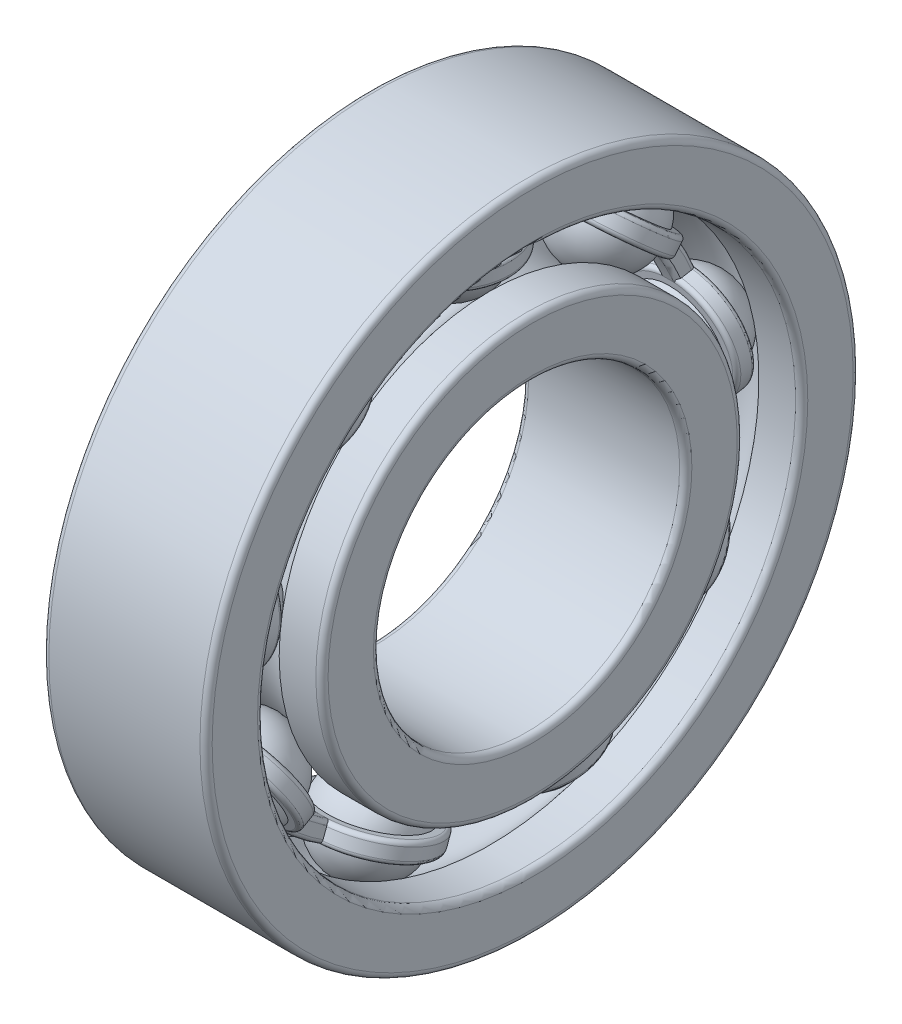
ISO-10303-21;
HEADER;
FILE_DESCRIPTION(('STEP AP214'),'2;1');
FILE_NAME('part.step','',(''),(''),'','','');
FILE_SCHEMA(('AUTOMOTIVE_DESIGN { 1 0 10303 214 1 1 1 1 }'));
ENDSEC;
DATA;
#1=APPLICATION_CONTEXT('core data for automotive mechanical design processes');
#2=APPLICATION_PROTOCOL_DEFINITION('international standard','automotive_design',2000,#1);
#3=PRODUCT_CONTEXT('',#1,'mechanical');
#4=PRODUCT('Part','Part','',(#3));
#5=PRODUCT_RELATED_PRODUCT_CATEGORY('part','',(#4));
#6=PRODUCT_DEFINITION_FORMATION('','',#4);
#7=PRODUCT_DEFINITION_CONTEXT('part definition',#1,'design');
#8=PRODUCT_DEFINITION('design','',#6,#7);
#9=PRODUCT_DEFINITION_SHAPE('','',#8);
#10=(LENGTH_UNIT() NAMED_UNIT(*) SI_UNIT(.MILLI.,.METRE.));
#11=(NAMED_UNIT(*) PLANE_ANGLE_UNIT() SI_UNIT($,.RADIAN.));
#12=(NAMED_UNIT(*) SI_UNIT($,.STERADIAN.) SOLID_ANGLE_UNIT());
#13=UNCERTAINTY_MEASURE_WITH_UNIT(LENGTH_MEASURE(1.E-05),#10,'distance_accuracy_value','');
#14=(GEOMETRIC_REPRESENTATION_CONTEXT(3) GLOBAL_UNCERTAINTY_ASSIGNED_CONTEXT((#13)) GLOBAL_UNIT_ASSIGNED_CONTEXT((#10,
#11,#12)) REPRESENTATION_CONTEXT('',''));
#15=CARTESIAN_POINT('',(0.,0.,0.));
#16=DIRECTION('',(0.,0.,1.));
#17=DIRECTION('',(1.,0.,0.));
#18=AXIS2_PLACEMENT_3D('',#15,#16,#17);
#19=CARTESIAN_POINT('',(0.,9.00102220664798,7.55275441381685));
#20=DIRECTION('',(1.,0.,0.));
#21=DIRECTION('',(0.,-0.766044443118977,-0.642787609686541));
#22=AXIS2_PLACEMENT_3D('',#19,#20,#21);
#23=SPHERICAL_SURFACE('',#22,2.381);
#24=CARTESIAN_POINT('',(-2.381,9.00102220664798,7.55275441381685));
#25=VERTEX_POINT('',#24);
#26=VERTEX_LOOP('',#25);
#27=FACE_BOUND('',#26,.T.);
#28=CARTESIAN_POINT('',(2.381,9.00102220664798,7.55275441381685));
#29=VERTEX_POINT('',#28);
#30=VERTEX_LOOP('',#29);
#31=FACE_BOUND('',#30,.T.);
#32=ADVANCED_FACE('P0_F16',(#27,#31),#23,.T.);
#33=CLOSED_SHELL('',(#32));
#34=MANIFOLD_SOLID_BREP('P0_B1',#33);
#35=CARTESIAN_POINT('',(0.,-5.73689999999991,-9.93660227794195));
#36=DIRECTION('',(0.,0.499999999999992,0.866025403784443));
#37=DIRECTION('',(0.,-0.866025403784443,0.499999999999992));
#38=AXIS2_PLACEMENT_3D('',#35,#36,#37);
#39=TOROIDAL_SURFACE('',#38,2.6572,0.2);
#40=CARTESIAN_POINT('',(0.,-5.73689999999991,-9.93660227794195));
#41=DIRECTION('',(0.,-0.499999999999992,-0.866025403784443));
#42=DIRECTION('',(0.,0.866025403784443,-0.499999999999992));
#43=AXIS2_PLACEMENT_3D('',#40,#41,#42);
#44=CIRCLE('',#43,2.8572);
#45=CARTESIAN_POINT('',(0.,-3.262492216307,-11.3652022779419));
#46=VERTEX_POINT('',#45);
#47=EDGE_CURVE('P1_E55',#46,#46,#44,.T.);
#48=ORIENTED_EDGE('',*,*,#47,.F.);
#49=EDGE_LOOP('',(#48));
#50=FACE_BOUND('',#49,.T.);
#51=CARTESIAN_POINT('',(0.,-5.63689999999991,-9.76339719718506));
#52=DIRECTION('',(0.,-0.499999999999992,-0.866025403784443));
#53=DIRECTION('',(0.,-0.866025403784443,0.499999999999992));
#54=AXIS2_PLACEMENT_3D('',#51,#52,#53);
#55=CIRCLE('',#54,2.6572);
#56=CARTESIAN_POINT('',(0.,-3.33569729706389,-11.091997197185));
#57=VERTEX_POINT('',#56);
#58=CARTESIAN_POINT('',(0.,-7.93810270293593,-8.43479719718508));
#59=VERTEX_POINT('',#58);
#60=EDGE_CURVE('P1_E47',#57,#59,#55,.F.);
#61=ORIENTED_EDGE('',*,*,#60,.F.);
#62=CARTESIAN_POINT('',(0.,-5.63689999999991,-9.76339719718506));
#63=DIRECTION('',(0.,-0.499999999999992,-0.866025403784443));
#64=DIRECTION('',(0.,0.866025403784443,-0.499999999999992));
#65=AXIS2_PLACEMENT_3D('',#62,#63,#64);
#66=CIRCLE('',#65,2.6572);
#67=EDGE_CURVE('P1_E45',#59,#57,#66,.F.);
#68=ORIENTED_EDGE('',*,*,#67,.F.);
#69=EDGE_LOOP('',(#61,#68));
#70=FACE_BOUND('',#69,.T.);
#71=ADVANCED_FACE('P1_F17',(#50,#70),#39,.T.);
#72=CARTESIAN_POINT('',(0.,-7.06549999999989,-12.237804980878));
#73=DIRECTION('',(0.,-0.499999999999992,-0.866025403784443));
#74=DIRECTION('',(0.,0.866025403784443,-0.499999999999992));
#75=AXIS2_PLACEMENT_3D('',#72,#73,#74);
#76=CYLINDRICAL_SURFACE('',#75,2.8572);
#77=ORIENTED_EDGE('',*,*,#47,.T.);
#78=EDGE_LOOP('',(#77));
#79=FACE_BOUND('',#78,.T.);
#80=CARTESIAN_POINT('',(0.,-6.0130999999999,-10.4149947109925));
#81=DIRECTION('',(0.,-0.499999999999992,-0.866025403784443));
#82=DIRECTION('',(0.,0.866025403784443,-0.499999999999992));
#83=AXIS2_PLACEMENT_3D('',#80,#81,#82);
#84=CIRCLE('',#83,2.8572);
#85=CARTESIAN_POINT('',(0.,-3.53869221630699,-11.8435947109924));
#86=VERTEX_POINT('',#85);
#87=EDGE_CURVE('P1_E51',#86,#86,#84,.T.);
#88=ORIENTED_EDGE('',*,*,#87,.F.);
#89=EDGE_LOOP('',(#88));
#90=FACE_BOUND('',#89,.T.);
#91=ADVANCED_FACE('P1_F73',(#79,#90),#76,.T.);
#92=CARTESIAN_POINT('',(-2.8572,-5.63689999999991,-9.76339719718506));
#93=DIRECTION('',(0.,0.499999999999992,0.866025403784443));
#94=DIRECTION('',(0.,-0.866025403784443,0.499999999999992));
#95=AXIS2_PLACEMENT_3D('',#92,#93,#94);
#96=PLANE('',#95);
#97=CARTESIAN_POINT('',(0.,-5.63689999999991,-9.76339719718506));
#98=DIRECTION('',(0.,-0.499999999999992,-0.866025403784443));
#99=DIRECTION('',(0.,0.866025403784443,-0.499999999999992));
#100=AXIS2_PLACEMENT_3D('',#97,#98,#99);
#101=CIRCLE('',#100,1.9048);
#102=CARTESIAN_POINT('',(0.,-3.9872948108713,-10.715797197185));
#103=VERTEX_POINT('',#102);
#104=EDGE_CURVE('P1_E88',#103,#103,#101,.T.);
#105=ORIENTED_EDGE('',*,*,#104,.T.);
#106=EDGE_LOOP('',(#105));
#107=FACE_BOUND('',#106,.T.);
#108=ORIENTED_EDGE('',*,*,#67,.T.);
#109=ORIENTED_EDGE('',*,*,#60,.T.);
#110=EDGE_LOOP('',(#108,#109));
#111=FACE_BOUND('',#110,.T.);
#112=ADVANCED_FACE('P1_F54',(#107,#111),#96,.T.);
#113=CARTESIAN_POINT('',(0.,-6.0130999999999,-10.4149947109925));
#114=DIRECTION('',(0.,-0.499999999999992,-0.866025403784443));
#115=DIRECTION('',(0.,0.866025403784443,-0.499999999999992));
#116=AXIS2_PLACEMENT_3D('',#113,#114,#115);
#117=TOROIDAL_SURFACE('',#116,2.6572,0.2);
#118=ORIENTED_EDGE('',*,*,#87,.T.);
#119=EDGE_LOOP('',(#118));
#120=FACE_BOUND('',#119,.T.);
#121=CARTESIAN_POINT('',(0.,-6.1130999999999,-10.5881997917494));
#122=DIRECTION('',(0.,0.499999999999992,0.866025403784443));
#123=DIRECTION('',(0.,0.866025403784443,-0.499999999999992));
#124=AXIS2_PLACEMENT_3D('',#121,#122,#123);
#125=CIRCLE('',#124,2.6572);
#126=CARTESIAN_POINT('',(0.,-8.41430270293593,-9.25959979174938));
#127=VERTEX_POINT('',#126);
#128=CARTESIAN_POINT('',(0.,-3.81189729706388,-11.9167997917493));
#129=VERTEX_POINT('',#128);
#130=EDGE_CURVE('P1_E29',#127,#129,#125,.F.);
#131=ORIENTED_EDGE('',*,*,#130,.F.);
#132=CARTESIAN_POINT('',(0.,-6.1130999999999,-10.5881997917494));
#133=DIRECTION('',(0.,0.499999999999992,0.866025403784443));
#134=DIRECTION('',(0.,-0.866025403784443,0.499999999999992));
#135=AXIS2_PLACEMENT_3D('',#132,#133,#134);
#136=CIRCLE('',#135,2.6572);
#137=EDGE_CURVE('P1_E93',#129,#127,#136,.F.);
#138=ORIENTED_EDGE('',*,*,#137,.F.);
#139=EDGE_LOOP('',(#131,#138));
#140=FACE_BOUND('',#139,.T.);
#141=ADVANCED_FACE('P1_F72',(#120,#140),#117,.T.);
#142=CARTESIAN_POINT('',(0.,-7.06549999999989,-12.237804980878));
#143=DIRECTION('',(0.,-0.499999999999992,-0.866025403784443));
#144=DIRECTION('',(0.,0.866025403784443,-0.499999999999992));
#145=AXIS2_PLACEMENT_3D('',#142,#143,#144);
#146=CYLINDRICAL_SURFACE('',#145,1.9048);
#147=CARTESIAN_POINT('',(0.,-6.1130999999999,-10.5881997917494));
#148=DIRECTION('',(0.,-0.499999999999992,-0.866025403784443));
#149=DIRECTION('',(0.,0.866025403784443,-0.499999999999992));
#150=AXIS2_PLACEMENT_3D('',#147,#148,#149);
#151=CIRCLE('',#150,1.9048);
#152=CARTESIAN_POINT('',(0.,-4.4634948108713,-11.5405997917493));
#153=VERTEX_POINT('',#152);
#154=EDGE_CURVE('P1_E11',#153,#153,#151,.F.);
#155=ORIENTED_EDGE('',*,*,#154,.F.);
#156=EDGE_LOOP('',(#155));
#157=FACE_BOUND('',#156,.T.);
#158=ORIENTED_EDGE('',*,*,#104,.F.);
#159=EDGE_LOOP('',(#158));
#160=FACE_BOUND('',#159,.T.);
#161=ADVANCED_FACE('P1_F125',(#157,#160),#146,.F.);
#162=CARTESIAN_POINT('',(-2.8572,-6.1130999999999,-10.5881997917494));
#163=DIRECTION('',(0.,-0.499999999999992,-0.866025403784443));
#164=DIRECTION('',(0.,0.866025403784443,-0.499999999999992));
#165=AXIS2_PLACEMENT_3D('',#162,#163,#164);
#166=PLANE('',#165);
#167=ORIENTED_EDGE('',*,*,#154,.T.);
#168=EDGE_LOOP('',(#167));
#169=FACE_BOUND('',#168,.T.);
#170=ORIENTED_EDGE('',*,*,#137,.T.);
#171=ORIENTED_EDGE('',*,*,#130,.T.);
#172=EDGE_LOOP('',(#170,#171));
#173=FACE_BOUND('',#172,.T.);
#174=ADVANCED_FACE('P1_F109',(#169,#173),#166,.T.);
#175=CLOSED_SHELL('',(#71,#91,#112,#141,#161,#174));
#176=MANIFOLD_SOLID_BREP('P1_B1',#175);
#177=CARTESIAN_POINT('',(0.,11.4738,0.));
#178=DIRECTION('',(0.,-1.,0.));
#179=DIRECTION('',(0.,0.,-1.));
#180=AXIS2_PLACEMENT_3D('',#177,#178,#179);
#181=TOROIDAL_SURFACE('',#180,2.6572,0.2);
#182=CARTESIAN_POINT('',(0.,11.4738,0.));
#183=DIRECTION('',(0.,1.,0.));
#184=DIRECTION('',(0.,0.,1.));
#185=AXIS2_PLACEMENT_3D('',#182,#183,#184);
#186=CIRCLE('',#185,2.8572);
#187=CARTESIAN_POINT('',(0.,11.4738,2.8572));
#188=VERTEX_POINT('',#187);
#189=EDGE_CURVE('P2_E55',#188,#188,#186,.T.);
#190=ORIENTED_EDGE('',*,*,#189,.F.);
#191=EDGE_LOOP('',(#190));
#192=FACE_BOUND('',#191,.T.);
#193=CARTESIAN_POINT('',(0.,11.2738,0.));
#194=DIRECTION('',(0.,1.,0.));
#195=DIRECTION('',(0.,0.,-1.));
#196=AXIS2_PLACEMENT_3D('',#193,#194,#195);
#197=CIRCLE('',#196,2.6572);
#198=CARTESIAN_POINT('',(0.,11.2738,2.6572));
#199=VERTEX_POINT('',#198);
#200=CARTESIAN_POINT('',(0.,11.2738,-2.6572));
#201=VERTEX_POINT('',#200);
#202=EDGE_CURVE('P2_E47',#199,#201,#197,.F.);
#203=ORIENTED_EDGE('',*,*,#202,.F.);
#204=CARTESIAN_POINT('',(0.,11.2738,0.));
#205=DIRECTION('',(0.,1.,0.));
#206=DIRECTION('',(0.,0.,1.));
#207=AXIS2_PLACEMENT_3D('',#204,#205,#206);
#208=CIRCLE('',#207,2.6572);
#209=EDGE_CURVE('P2_E45',#201,#199,#208,.F.);
#210=ORIENTED_EDGE('',*,*,#209,.F.);
#211=EDGE_LOOP('',(#203,#210));
#212=FACE_BOUND('',#211,.T.);
#213=ADVANCED_FACE('P2_F17',(#192,#212),#181,.T.);
#214=CARTESIAN_POINT('',(0.,14.131,0.));
#215=DIRECTION('',(0.,1.,0.));
#216=DIRECTION('',(0.,0.,1.));
#217=AXIS2_PLACEMENT_3D('',#214,#215,#216);
#218=CYLINDRICAL_SURFACE('',#217,2.8572);
#219=ORIENTED_EDGE('',*,*,#189,.T.);
#220=EDGE_LOOP('',(#219));
#221=FACE_BOUND('',#220,.T.);
#222=CARTESIAN_POINT('',(0.,12.0262,0.));
#223=DIRECTION('',(0.,1.,0.));
#224=DIRECTION('',(0.,0.,1.));
#225=AXIS2_PLACEMENT_3D('',#222,#223,#224);
#226=CIRCLE('',#225,2.8572);
#227=CARTESIAN_POINT('',(0.,12.0262,2.8572));
#228=VERTEX_POINT('',#227);
#229=EDGE_CURVE('P2_E51',#228,#228,#226,.T.);
#230=ORIENTED_EDGE('',*,*,#229,.F.);
#231=EDGE_LOOP('',(#230));
#232=FACE_BOUND('',#231,.T.);
#233=ADVANCED_FACE('P2_F73',(#221,#232),#218,.T.);
#234=CARTESIAN_POINT('',(-2.8572,11.2738,0.));
#235=DIRECTION('',(0.,-1.,0.));
#236=DIRECTION('',(0.,0.,-1.));
#237=AXIS2_PLACEMENT_3D('',#234,#235,#236);
#238=PLANE('',#237);
#239=CARTESIAN_POINT('',(0.,11.2738,0.));
#240=DIRECTION('',(0.,1.,0.));
#241=DIRECTION('',(0.,0.,1.));
#242=AXIS2_PLACEMENT_3D('',#239,#240,#241);
#243=CIRCLE('',#242,1.9048);
#244=CARTESIAN_POINT('',(0.,11.2738,1.9048));
#245=VERTEX_POINT('',#244);
#246=EDGE_CURVE('P2_E88',#245,#245,#243,.T.);
#247=ORIENTED_EDGE('',*,*,#246,.T.);
#248=EDGE_LOOP('',(#247));
#249=FACE_BOUND('',#248,.T.);
#250=ORIENTED_EDGE('',*,*,#209,.T.);
#251=ORIENTED_EDGE('',*,*,#202,.T.);
#252=EDGE_LOOP('',(#250,#251));
#253=FACE_BOUND('',#252,.T.);
#254=ADVANCED_FACE('P2_F54',(#249,#253),#238,.T.);
#255=CARTESIAN_POINT('',(0.,12.0262,0.));
#256=DIRECTION('',(0.,1.,0.));
#257=DIRECTION('',(0.,0.,1.));
#258=AXIS2_PLACEMENT_3D('',#255,#256,#257);
#259=TOROIDAL_SURFACE('',#258,2.6572,0.2);
#260=ORIENTED_EDGE('',*,*,#229,.T.);
#261=EDGE_LOOP('',(#260));
#262=FACE_BOUND('',#261,.T.);
#263=CARTESIAN_POINT('',(0.,12.2262,0.));
#264=DIRECTION('',(0.,-1.,0.));
#265=DIRECTION('',(0.,0.,1.));
#266=AXIS2_PLACEMENT_3D('',#263,#264,#265);
#267=CIRCLE('',#266,2.6572);
#268=CARTESIAN_POINT('',(0.,12.2262,-2.6572));
#269=VERTEX_POINT('',#268);
#270=CARTESIAN_POINT('',(0.,12.2262,2.6572));
#271=VERTEX_POINT('',#270);
#272=EDGE_CURVE('P2_E29',#269,#271,#267,.F.);
#273=ORIENTED_EDGE('',*,*,#272,.F.);
#274=CARTESIAN_POINT('',(0.,12.2262,0.));
#275=DIRECTION('',(0.,-1.,0.));
#276=DIRECTION('',(0.,0.,-1.));
#277=AXIS2_PLACEMENT_3D('',#274,#275,#276);
#278=CIRCLE('',#277,2.6572);
#279=EDGE_CURVE('P2_E93',#271,#269,#278,.F.);
#280=ORIENTED_EDGE('',*,*,#279,.F.);
#281=EDGE_LOOP('',(#273,#280));
#282=FACE_BOUND('',#281,.T.);
#283=ADVANCED_FACE('P2_F72',(#262,#282),#259,.T.);
#284=CARTESIAN_POINT('',(0.,14.131,0.));
#285=DIRECTION('',(0.,1.,0.));
#286=DIRECTION('',(0.,0.,1.));
#287=AXIS2_PLACEMENT_3D('',#284,#285,#286);
#288=CYLINDRICAL_SURFACE('',#287,1.9048);
#289=CARTESIAN_POINT('',(0.,12.2262,0.));
#290=DIRECTION('',(0.,1.,0.));
#291=DIRECTION('',(0.,0.,1.));
#292=AXIS2_PLACEMENT_3D('',#289,#290,#291);
#293=CIRCLE('',#292,1.9048);
#294=CARTESIAN_POINT('',(0.,12.2262,1.9048));
#295=VERTEX_POINT('',#294);
#296=EDGE_CURVE('P2_E11',#295,#295,#293,.F.);
#297=ORIENTED_EDGE('',*,*,#296,.F.);
#298=EDGE_LOOP('',(#297));
#299=FACE_BOUND('',#298,.T.);
#300=ORIENTED_EDGE('',*,*,#246,.F.);
#301=EDGE_LOOP('',(#300));
#302=FACE_BOUND('',#301,.T.);
#303=ADVANCED_FACE('P2_F125',(#299,#302),#288,.F.);
#304=CARTESIAN_POINT('',(-2.8572,12.2262,0.));
#305=DIRECTION('',(0.,1.,0.));
#306=DIRECTION('',(0.,0.,1.));
#307=AXIS2_PLACEMENT_3D('',#304,#305,#306);
#308=PLANE('',#307);
#309=ORIENTED_EDGE('',*,*,#296,.T.);
#310=EDGE_LOOP('',(#309));
#311=FACE_BOUND('',#310,.T.);
#312=ORIENTED_EDGE('',*,*,#279,.T.);
#313=ORIENTED_EDGE('',*,*,#272,.T.);
#314=EDGE_LOOP('',(#312,#313));
#315=FACE_BOUND('',#314,.T.);
#316=ADVANCED_FACE('P2_F109',(#311,#315),#308,.T.);
#317=CLOSED_SHELL('',(#213,#233,#254,#283,#303,#316));
#318=MANIFOLD_SOLID_BREP('P2_B1',#317);
#319=CARTESIAN_POINT('',(0.,2.04036608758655,-11.5714910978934));
#320=DIRECTION('',(1.,0.,0.));
#321=DIRECTION('',(0.,-0.17364817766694,0.984807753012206));
#322=AXIS2_PLACEMENT_3D('',#319,#320,#321);
#323=SPHERICAL_SURFACE('',#322,2.381);
#324=CARTESIAN_POINT('',(2.381,2.04036608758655,-11.5714910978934));
#325=VERTEX_POINT('',#324);
#326=VERTEX_LOOP('',#325);
#327=FACE_BOUND('',#326,.T.);
#328=CARTESIAN_POINT('',(-2.381,2.04036608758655,-11.5714910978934));
#329=VERTEX_POINT('',#328);
#330=VERTEX_LOOP('',#329);
#331=FACE_BOUND('',#330,.T.);
#332=ADVANCED_FACE('P3_F16',(#327,#331),#323,.T.);
#333=CLOSED_SHELL('',(#332));
#334=MANIFOLD_SOLID_BREP('P3_B1',#333);
#335=CARTESIAN_POINT('',(0.,9.00102220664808,-7.55275441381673));
#336=DIRECTION('',(1.,0.,0.));
#337=DIRECTION('',(0.,-0.766044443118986,0.64278760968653));
#338=AXIS2_PLACEMENT_3D('',#335,#336,#337);
#339=SPHERICAL_SURFACE('',#338,2.381);
#340=CARTESIAN_POINT('',(2.381,9.00102220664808,-7.55275441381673));
#341=VERTEX_POINT('',#340);
#342=VERTEX_LOOP('',#341);
#343=FACE_BOUND('',#342,.T.);
#344=CARTESIAN_POINT('',(-2.381,9.00102220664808,-7.55275441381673));
#345=VERTEX_POINT('',#344);
#346=VERTEX_LOOP('',#345);
#347=FACE_BOUND('',#346,.T.);
#348=ADVANCED_FACE('P4_F16',(#343,#347),#339,.T.);
#349=CLOSED_SHELL('',(#348));
#350=MANIFOLD_SOLID_BREP('P4_B1',#349);
#351=CARTESIAN_POINT('',(0.,-5.87500000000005,10.1757984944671));
#352=DIRECTION('',(1.,0.,0.));
#353=DIRECTION('',(0.,0.500000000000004,-0.866025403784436));
#354=AXIS2_PLACEMENT_3D('',#351,#352,#353);
#355=SPHERICAL_SURFACE('',#354,2.381);
#356=CARTESIAN_POINT('',(-2.381,-5.87500000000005,10.1757984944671));
#357=VERTEX_POINT('',#356);
#358=VERTEX_LOOP('',#357);
#359=FACE_BOUND('',#358,.T.);
#360=CARTESIAN_POINT('',(2.381,-5.87500000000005,10.1757984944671));
#361=VERTEX_POINT('',#360);
#362=VERTEX_LOOP('',#361);
#363=FACE_BOUND('',#362,.T.);
#364=ADVANCED_FACE('P5_F16',(#359,#363),#355,.T.);
#365=CLOSED_SHELL('',(#364));
#366=MANIFOLD_SOLID_BREP('P5_B1',#365);
#367=CARTESIAN_POINT('',(0.,-5.73690000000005,9.93660227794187));
#368=DIRECTION('',(0.,0.500000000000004,-0.866025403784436));
#369=DIRECTION('',(0.,0.866025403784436,0.500000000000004));
#370=AXIS2_PLACEMENT_3D('',#367,#368,#369);
#371=TOROIDAL_SURFACE('',#370,2.6572,0.2);
#372=CARTESIAN_POINT('',(0.,-5.73690000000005,9.93660227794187));
#373=DIRECTION('',(0.,-0.500000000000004,0.866025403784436));
#374=DIRECTION('',(0.,-0.866025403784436,-0.500000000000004));
#375=AXIS2_PLACEMENT_3D('',#372,#373,#374);
#376=CIRCLE('',#375,2.8572);
#377=CARTESIAN_POINT('',(0.,-8.21130778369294,8.50800227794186));
#378=VERTEX_POINT('',#377);
#379=EDGE_CURVE('P6_E55',#378,#378,#376,.T.);
#380=ORIENTED_EDGE('',*,*,#379,.F.);
#381=EDGE_LOOP('',(#380));
#382=FACE_BOUND('',#381,.T.);
#383=CARTESIAN_POINT('',(0.,-5.63690000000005,9.76339719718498));
#384=DIRECTION('',(0.,-0.500000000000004,0.866025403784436));
#385=DIRECTION('',(0.,0.866025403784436,0.500000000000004));
#386=AXIS2_PLACEMENT_3D('',#383,#384,#385);
#387=CIRCLE('',#386,2.6572);
#388=CARTESIAN_POINT('',(0.,-7.93810270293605,8.43479719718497));
#389=VERTEX_POINT('',#388);
#390=CARTESIAN_POINT('',(0.,-3.33569729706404,11.091997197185));
#391=VERTEX_POINT('',#390);
#392=EDGE_CURVE('P6_E47',#389,#391,#387,.F.);
#393=ORIENTED_EDGE('',*,*,#392,.F.);
#394=CARTESIAN_POINT('',(0.,-5.63690000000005,9.76339719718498));
#395=DIRECTION('',(0.,-0.500000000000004,0.866025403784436));
#396=DIRECTION('',(0.,-0.866025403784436,-0.500000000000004));
#397=AXIS2_PLACEMENT_3D('',#394,#395,#396);
#398=CIRCLE('',#397,2.6572);
#399=EDGE_CURVE('P6_E45',#391,#389,#398,.F.);
#400=ORIENTED_EDGE('',*,*,#399,.F.);
#401=EDGE_LOOP('',(#393,#400));
#402=FACE_BOUND('',#401,.T.);
#403=ADVANCED_FACE('P6_F17',(#382,#402),#371,.T.);
#404=CARTESIAN_POINT('',(0.,-7.06550000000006,12.2378049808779));
#405=DIRECTION('',(0.,-0.500000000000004,0.866025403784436));
#406=DIRECTION('',(0.,-0.866025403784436,-0.500000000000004));
#407=AXIS2_PLACEMENT_3D('',#404,#405,#406);
#408=CYLINDRICAL_SURFACE('',#407,2.8572);
#409=ORIENTED_EDGE('',*,*,#379,.T.);
#410=EDGE_LOOP('',(#409));
#411=FACE_BOUND('',#410,.T.);
#412=CARTESIAN_POINT('',(0.,-6.01310000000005,10.4149947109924));
#413=DIRECTION('',(0.,-0.500000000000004,0.866025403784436));
#414=DIRECTION('',(0.,-0.866025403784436,-0.500000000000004));
#415=AXIS2_PLACEMENT_3D('',#412,#413,#414);
#416=CIRCLE('',#415,2.8572);
#417=CARTESIAN_POINT('',(0.,-8.48750778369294,8.98639471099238));
#418=VERTEX_POINT('',#417);
#419=EDGE_CURVE('P6_E51',#418,#418,#416,.T.);
#420=ORIENTED_EDGE('',*,*,#419,.F.);
#421=EDGE_LOOP('',(#420));
#422=FACE_BOUND('',#421,.T.);
#423=ADVANCED_FACE('P6_F73',(#411,#422),#408,.T.);
#424=CARTESIAN_POINT('',(-2.8572,-5.63690000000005,9.76339719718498));
#425=DIRECTION('',(0.,0.500000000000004,-0.866025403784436));
#426=DIRECTION('',(0.,0.866025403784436,0.500000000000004));
#427=AXIS2_PLACEMENT_3D('',#424,#425,#426);
#428=PLANE('',#427);
#429=CARTESIAN_POINT('',(0.,-5.63690000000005,9.76339719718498));
#430=DIRECTION('',(0.,-0.500000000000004,0.866025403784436));
#431=DIRECTION('',(0.,-0.866025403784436,-0.500000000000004));
#432=AXIS2_PLACEMENT_3D('',#429,#430,#431);
#433=CIRCLE('',#432,1.9048);
#434=CARTESIAN_POINT('',(0.,-7.28650518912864,8.81099719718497));
#435=VERTEX_POINT('',#434);
#436=EDGE_CURVE('P6_E88',#435,#435,#433,.T.);
#437=ORIENTED_EDGE('',*,*,#436,.T.);
#438=EDGE_LOOP('',(#437));
#439=FACE_BOUND('',#438,.T.);
#440=ORIENTED_EDGE('',*,*,#399,.T.);
#441=ORIENTED_EDGE('',*,*,#392,.T.);
#442=EDGE_LOOP('',(#440,#441));
#443=FACE_BOUND('',#442,.T.);
#444=ADVANCED_FACE('P6_F54',(#439,#443),#428,.T.);
#445=CARTESIAN_POINT('',(0.,-6.01310000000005,10.4149947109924));
#446=DIRECTION('',(0.,-0.500000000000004,0.866025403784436));
#447=DIRECTION('',(0.,-0.866025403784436,-0.500000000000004));
#448=AXIS2_PLACEMENT_3D('',#445,#446,#447);
#449=TOROIDAL_SURFACE('',#448,2.6572,0.2);
#450=ORIENTED_EDGE('',*,*,#419,.T.);
#451=EDGE_LOOP('',(#450));
#452=FACE_BOUND('',#451,.T.);
#453=CARTESIAN_POINT('',(0.,-6.11310000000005,10.5881997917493));
#454=DIRECTION('',(0.,0.500000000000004,-0.866025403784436));
#455=DIRECTION('',(0.,-0.866025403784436,-0.500000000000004));
#456=AXIS2_PLACEMENT_3D('',#453,#454,#455);
#457=CIRCLE('',#456,2.6572);
#458=CARTESIAN_POINT('',(0.,-3.81189729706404,11.9167997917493));
#459=VERTEX_POINT('',#458);
#460=CARTESIAN_POINT('',(0.,-8.41430270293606,9.25959979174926));
#461=VERTEX_POINT('',#460);
#462=EDGE_CURVE('P6_E29',#459,#461,#457,.F.);
#463=ORIENTED_EDGE('',*,*,#462,.F.);
#464=CARTESIAN_POINT('',(0.,-6.11310000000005,10.5881997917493));
#465=DIRECTION('',(0.,0.500000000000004,-0.866025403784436));
#466=DIRECTION('',(0.,0.866025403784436,0.500000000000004));
#467=AXIS2_PLACEMENT_3D('',#464,#465,#466);
#468=CIRCLE('',#467,2.6572);
#469=EDGE_CURVE('P6_E93',#461,#459,#468,.F.);
#470=ORIENTED_EDGE('',*,*,#469,.F.);
#471=EDGE_LOOP('',(#463,#470));
#472=FACE_BOUND('',#471,.T.);
#473=ADVANCED_FACE('P6_F72',(#452,#472),#449,.T.);
#474=CARTESIAN_POINT('',(0.,-7.06550000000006,12.2378049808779));
#475=DIRECTION('',(0.,-0.500000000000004,0.866025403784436));
#476=DIRECTION('',(0.,-0.866025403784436,-0.500000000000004));
#477=AXIS2_PLACEMENT_3D('',#474,#475,#476);
#478=CYLINDRICAL_SURFACE('',#477,1.9048);
#479=CARTESIAN_POINT('',(0.,-6.11310000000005,10.5881997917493));
#480=DIRECTION('',(0.,-0.500000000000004,0.866025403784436));
#481=DIRECTION('',(0.,-0.866025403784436,-0.500000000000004));
#482=AXIS2_PLACEMENT_3D('',#479,#480,#481);
#483=CIRCLE('',#482,1.9048);
#484=CARTESIAN_POINT('',(0.,-7.76270518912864,9.63579979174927));
#485=VERTEX_POINT('',#484);
#486=EDGE_CURVE('P6_E11',#485,#485,#483,.F.);
#487=ORIENTED_EDGE('',*,*,#486,.F.);
#488=EDGE_LOOP('',(#487));
#489=FACE_BOUND('',#488,.T.);
#490=ORIENTED_EDGE('',*,*,#436,.F.);
#491=EDGE_LOOP('',(#490));
#492=FACE_BOUND('',#491,.T.);
#493=ADVANCED_FACE('P6_F125',(#489,#492),#478,.F.);
#494=CARTESIAN_POINT('',(-2.8572,-6.11310000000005,10.5881997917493));
#495=DIRECTION('',(0.,-0.500000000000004,0.866025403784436));
#496=DIRECTION('',(0.,-0.866025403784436,-0.500000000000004));
#497=AXIS2_PLACEMENT_3D('',#494,#495,#496);
#498=PLANE('',#497);
#499=ORIENTED_EDGE('',*,*,#486,.T.);
#500=EDGE_LOOP('',(#499));
#501=FACE_BOUND('',#500,.T.);
#502=ORIENTED_EDGE('',*,*,#469,.T.);
#503=ORIENTED_EDGE('',*,*,#462,.T.);
#504=EDGE_LOOP('',(#502,#503));
#505=FACE_BOUND('',#504,.T.);
#506=ADVANCED_FACE('P6_F109',(#501,#505),#498,.T.);
#507=CLOSED_SHELL('',(#403,#423,#444,#473,#493,#506));
#508=MANIFOLD_SOLID_BREP('P6_B1',#507);
#509=CARTESIAN_POINT('',(0.,-5.87499999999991,-10.1757984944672));
#510=DIRECTION('',(1.,0.,0.));
#511=DIRECTION('',(0.,0.499999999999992,0.866025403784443));
#512=AXIS2_PLACEMENT_3D('',#509,#510,#511);
#513=SPHERICAL_SURFACE('',#512,2.381);
#514=CARTESIAN_POINT('',(-2.381,-5.87499999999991,-10.1757984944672));
#515=VERTEX_POINT('',#514);
#516=VERTEX_LOOP('',#515);
#517=FACE_BOUND('',#516,.T.);
#518=CARTESIAN_POINT('',(2.381,-5.87499999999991,-10.1757984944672));
#519=VERTEX_POINT('',#518);
#520=VERTEX_LOOP('',#519);
#521=FACE_BOUND('',#520,.T.);
#522=ADVANCED_FACE('P7_F16',(#517,#521),#513,.T.);
#523=CLOSED_SHELL('',(#522));
#524=MANIFOLD_SOLID_BREP('P7_B1',#523);
#525=CARTESIAN_POINT('',(0.,-11.3009313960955,-4.11320264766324));
#526=DIRECTION('',(0.,-0.939692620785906,-0.342020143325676));
#527=DIRECTION('',(0.,0.342020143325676,-0.939692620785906));
#528=AXIS2_PLACEMENT_3D('',#525,#526,#527);
#529=TOROIDAL_SURFACE('',#528,2.6572,0.2);
#530=CARTESIAN_POINT('',(0.,-11.3009313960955,-4.11320264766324));
#531=DIRECTION('',(0.,-0.939692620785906,-0.342020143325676));
#532=DIRECTION('',(0.,0.342020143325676,-0.939692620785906));
#533=AXIS2_PLACEMENT_3D('',#530,#531,#532);
#534=CIRCLE('',#533,2.8572);
#535=CARTESIAN_POINT('',(0.,-10.3237114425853,-6.79809240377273));
#536=VERTEX_POINT('',#535);
#537=EDGE_CURVE('P8_E55',#536,#536,#534,.F.);
#538=ORIENTED_EDGE('',*,*,#537,.F.);
#539=EDGE_LOOP('',(#538));
#540=FACE_BOUND('',#539,.T.);
#541=CARTESIAN_POINT('',(0.,-11.4888699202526,-4.18160667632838));
#542=DIRECTION('',(0.,0.939692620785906,0.342020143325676));
#543=DIRECTION('',(0.,0.342020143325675,-0.939692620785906));
#544=AXIS2_PLACEMENT_3D('',#541,#542,#543);
#545=CIRCLE('',#544,2.6572);
#546=CARTESIAN_POINT('',(0.,-12.3976858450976,-1.68465544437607));
#547=VERTEX_POINT('',#546);
#548=CARTESIAN_POINT('',(0.,-10.5800539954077,-6.67855790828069));
#549=VERTEX_POINT('',#548);
#550=EDGE_CURVE('P8_E47',#547,#549,#545,.F.);
#551=ORIENTED_EDGE('',*,*,#550,.F.);
#552=CARTESIAN_POINT('',(0.,-11.4888699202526,-4.18160667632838));
#553=DIRECTION('',(0.,0.939692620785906,0.342020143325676));
#554=DIRECTION('',(0.,-0.342020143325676,0.939692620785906));
#555=AXIS2_PLACEMENT_3D('',#552,#553,#554);
#556=CIRCLE('',#555,2.6572);
#557=EDGE_CURVE('P8_E45',#549,#547,#556,.F.);
#558=ORIENTED_EDGE('',*,*,#557,.F.);
#559=EDGE_LOOP('',(#551,#558));
#560=FACE_BOUND('',#559,.T.);
#561=ADVANCED_FACE('P8_F17',(#540,#560),#529,.T.);
#562=CARTESIAN_POINT('',(0.,-13.2787964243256,-4.83308664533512));
#563=DIRECTION('',(0.,-0.939692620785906,-0.342020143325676));
#564=DIRECTION('',(0.,0.342020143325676,-0.939692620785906));
#565=AXIS2_PLACEMENT_3D('',#562,#563,#564);
#566=CYLINDRICAL_SURFACE('',#565,2.8572);
#567=CARTESIAN_POINT('',(0.,-10.7818451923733,-3.92427072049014));
#568=DIRECTION('',(0.,0.939692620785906,0.342020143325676));
#569=DIRECTION('',(0.,-0.342020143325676,0.939692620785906));
#570=AXIS2_PLACEMENT_3D('',#567,#568,#569);
#571=CIRCLE('',#570,2.8572);
#572=CARTESIAN_POINT('',(0.,-11.7590651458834,-1.23938096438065));
#573=VERTEX_POINT('',#572);
#574=EDGE_CURVE('P8_E51',#573,#573,#571,.T.);
#575=ORIENTED_EDGE('',*,*,#574,.F.);
#576=EDGE_LOOP('',(#575));
#577=FACE_BOUND('',#576,.T.);
#578=ORIENTED_EDGE('',*,*,#537,.T.);
#579=EDGE_LOOP('',(#578));
#580=FACE_BOUND('',#579,.T.);
#581=ADVANCED_FACE('P8_F73',(#577,#580),#566,.T.);
#582=CARTESIAN_POINT('',(-2.8572,-11.4888699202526,-4.18160667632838));
#583=DIRECTION('',(0.,-0.939692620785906,-0.342020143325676));
#584=DIRECTION('',(0.,0.342020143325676,-0.939692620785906));
#585=AXIS2_PLACEMENT_3D('',#582,#583,#584);
#586=PLANE('',#585);
#587=CARTESIAN_POINT('',(0.,-11.4888699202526,-4.18160667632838));
#588=DIRECTION('',(0.,-0.939692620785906,-0.342020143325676));
#589=DIRECTION('',(0.,0.342020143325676,-0.939692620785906));
#590=AXIS2_PLACEMENT_3D('',#587,#588,#589);
#591=CIRCLE('',#590,1.9048);
#592=CARTESIAN_POINT('',(0.,-10.8373899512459,-5.97153318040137));
#593=VERTEX_POINT('',#592);
#594=EDGE_CURVE('P8_E88',#593,#593,#591,.F.);
#595=ORIENTED_EDGE('',*,*,#594,.T.);
#596=EDGE_LOOP('',(#595));
#597=FACE_BOUND('',#596,.T.);
#598=ORIENTED_EDGE('',*,*,#557,.T.);
#599=ORIENTED_EDGE('',*,*,#550,.T.);
#600=EDGE_LOOP('',(#598,#599));
#601=FACE_BOUND('',#600,.T.);
#602=ADVANCED_FACE('P8_F54',(#597,#601),#586,.T.);
#603=CARTESIAN_POINT('',(0.,-10.7818451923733,-3.92427072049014));
#604=DIRECTION('',(0.,0.939692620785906,0.342020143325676));
#605=DIRECTION('',(0.,-0.342020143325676,0.939692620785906));
#606=AXIS2_PLACEMENT_3D('',#603,#604,#605);
#607=TOROIDAL_SURFACE('',#606,2.6572,0.2);
#608=ORIENTED_EDGE('',*,*,#574,.T.);
#609=EDGE_LOOP('',(#608));
#610=FACE_BOUND('',#609,.T.);
#611=CARTESIAN_POINT('',(0.,-10.5939066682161,-3.855866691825));
#612=DIRECTION('',(0.,-0.939692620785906,-0.342020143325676));
#613=DIRECTION('',(0.,-0.342020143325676,0.939692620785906));
#614=AXIS2_PLACEMENT_3D('',#611,#612,#613);
#615=CIRCLE('',#614,2.6572);
#616=CARTESIAN_POINT('',(0.,-9.68509074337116,-6.35281792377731));
#617=VERTEX_POINT('',#616);
#618=CARTESIAN_POINT('',(0.,-11.5027225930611,-1.35891545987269));
#619=VERTEX_POINT('',#618);
#620=EDGE_CURVE('P8_E29',#617,#619,#615,.F.);
#621=ORIENTED_EDGE('',*,*,#620,.F.);
#622=CARTESIAN_POINT('',(0.,-10.5939066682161,-3.855866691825));
#623=DIRECTION('',(0.,-0.939692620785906,-0.342020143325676));
#624=DIRECTION('',(0.,0.342020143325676,-0.939692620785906));
#625=AXIS2_PLACEMENT_3D('',#622,#623,#624);
#626=CIRCLE('',#625,2.6572);
#627=EDGE_CURVE('P8_E93',#619,#617,#626,.F.);
#628=ORIENTED_EDGE('',*,*,#627,.F.);
#629=EDGE_LOOP('',(#621,#628));
#630=FACE_BOUND('',#629,.T.);
#631=ADVANCED_FACE('P8_F72',(#610,#630),#607,.T.);
#632=CARTESIAN_POINT('',(0.,-13.2787964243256,-4.83308664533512));
#633=DIRECTION('',(0.,-0.939692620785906,-0.342020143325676));
#634=DIRECTION('',(0.,0.342020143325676,-0.939692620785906));
#635=AXIS2_PLACEMENT_3D('',#632,#633,#634);
#636=CYLINDRICAL_SURFACE('',#635,1.9048);
#637=ORIENTED_EDGE('',*,*,#594,.F.);
#638=EDGE_LOOP('',(#637));
#639=FACE_BOUND('',#638,.T.);
#640=CARTESIAN_POINT('',(0.,-10.5939066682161,-3.855866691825));
#641=DIRECTION('',(0.,-0.939692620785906,-0.342020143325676));
#642=DIRECTION('',(0.,0.342020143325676,-0.939692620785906));
#643=AXIS2_PLACEMENT_3D('',#640,#641,#642);
#644=CIRCLE('',#643,1.9048);
#645=CARTESIAN_POINT('',(0.,-9.9424266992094,-5.645793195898));
#646=VERTEX_POINT('',#645);
#647=EDGE_CURVE('P8_E11',#646,#646,#644,.T.);
#648=ORIENTED_EDGE('',*,*,#647,.F.);
#649=EDGE_LOOP('',(#648));
#650=FACE_BOUND('',#649,.T.);
#651=ADVANCED_FACE('P8_F125',(#639,#650),#636,.F.);
#652=CARTESIAN_POINT('',(-2.8572,-10.5939066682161,-3.855866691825));
#653=DIRECTION('',(0.,0.939692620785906,0.342020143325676));
#654=DIRECTION('',(0.,-0.342020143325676,0.939692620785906));
#655=AXIS2_PLACEMENT_3D('',#652,#653,#654);
#656=PLANE('',#655);
#657=ORIENTED_EDGE('',*,*,#647,.T.);
#658=EDGE_LOOP('',(#657));
#659=FACE_BOUND('',#658,.T.);
#660=ORIENTED_EDGE('',*,*,#627,.T.);
#661=ORIENTED_EDGE('',*,*,#620,.T.);
#662=EDGE_LOOP('',(#660,#661));
#663=FACE_BOUND('',#662,.T.);
#664=ADVANCED_FACE('P8_F109',(#659,#663),#656,.T.);
#665=CLOSED_SHELL('',(#561,#581,#602,#631,#651,#664));
#666=MANIFOLD_SOLID_BREP('P8_B1',#665);
#667=CARTESIAN_POINT('',(0.,-11.0413882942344,-4.01873668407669));
#668=DIRECTION('',(1.,0.,0.));
#669=DIRECTION('',(0.,0.939692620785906,0.342020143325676));
#670=AXIS2_PLACEMENT_3D('',#667,#668,#669);
#671=SPHERICAL_SURFACE('',#670,2.381);
#672=CARTESIAN_POINT('',(2.381,-11.0413882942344,-4.01873668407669));
#673=VERTEX_POINT('',#672);
#674=VERTEX_LOOP('',#673);
#675=FACE_BOUND('',#674,.T.);
#676=CARTESIAN_POINT('',(-2.381,-11.0413882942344,-4.01873668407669));
#677=VERTEX_POINT('',#676);
#678=VERTEX_LOOP('',#677);
#679=FACE_BOUND('',#678,.T.);
#680=ADVANCED_FACE('P9_F16',(#675,#679),#671,.T.);
#681=CLOSED_SHELL('',(#680));
#682=MANIFOLD_SOLID_BREP('P9_B1',#681);
#683=CARTESIAN_POINT('',(0.,-11.3009313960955,4.11320264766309));
#684=DIRECTION('',(0.,-0.939692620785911,0.342020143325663));
#685=DIRECTION('',(0.,-0.342020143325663,-0.93969262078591));
#686=AXIS2_PLACEMENT_3D('',#683,#684,#685);
#687=TOROIDAL_SURFACE('',#686,2.6572,0.2);
#688=CARTESIAN_POINT('',(0.,-11.3009313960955,4.11320264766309));
#689=DIRECTION('',(0.,-0.939692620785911,0.342020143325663));
#690=DIRECTION('',(0.,-0.342020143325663,-0.939692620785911));
#691=AXIS2_PLACEMENT_3D('',#688,#689,#690);
#692=CIRCLE('',#691,2.8572);
#693=CARTESIAN_POINT('',(0.,-12.2781513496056,1.42831289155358));
#694=VERTEX_POINT('',#693);
#695=EDGE_CURVE('P10_E55',#694,#694,#692,.F.);
#696=ORIENTED_EDGE('',*,*,#695,.F.);
#697=EDGE_LOOP('',(#696));
#698=FACE_BOUND('',#697,.T.);
#699=CARTESIAN_POINT('',(0.,-11.4888699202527,4.18160667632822));
#700=DIRECTION('',(0.,0.939692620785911,-0.342020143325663));
#701=DIRECTION('',(0.,-0.342020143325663,-0.939692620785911));
#702=AXIS2_PLACEMENT_3D('',#699,#700,#701);
#703=CIRCLE('',#702,2.6572);
#704=CARTESIAN_POINT('',(0.,-10.5800539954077,6.67855790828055));
#705=VERTEX_POINT('',#704);
#706=CARTESIAN_POINT('',(0.,-12.3976858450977,1.6846554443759));
#707=VERTEX_POINT('',#706);
#708=EDGE_CURVE('P10_E47',#705,#707,#703,.F.);
#709=ORIENTED_EDGE('',*,*,#708,.F.);
#710=CARTESIAN_POINT('',(0.,-11.4888699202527,4.18160667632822));
#711=DIRECTION('',(0.,0.939692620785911,-0.342020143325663));
#712=DIRECTION('',(0.,0.342020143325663,0.93969262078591));
#713=AXIS2_PLACEMENT_3D('',#710,#711,#712);
#714=CIRCLE('',#713,2.6572);
#715=EDGE_CURVE('P10_E45',#707,#705,#714,.F.);
#716=ORIENTED_EDGE('',*,*,#715,.F.);
#717=EDGE_LOOP('',(#709,#716));
#718=FACE_BOUND('',#717,.T.);
#719=ADVANCED_FACE('P10_F17',(#698,#718),#687,.T.);
#720=CARTESIAN_POINT('',(0.,-13.2787964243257,4.83308664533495));
#721=DIRECTION('',(0.,-0.939692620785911,0.342020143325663));
#722=DIRECTION('',(0.,-0.342020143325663,-0.939692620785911));
#723=AXIS2_PLACEMENT_3D('',#720,#721,#722);
#724=CYLINDRICAL_SURFACE('',#723,2.8572);
#725=CARTESIAN_POINT('',(0.,-10.7818451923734,3.92427072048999));
#726=DIRECTION('',(0.,0.939692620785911,-0.342020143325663));
#727=DIRECTION('',(0.,0.342020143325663,0.93969262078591));
#728=AXIS2_PLACEMENT_3D('',#725,#726,#727);
#729=CIRCLE('',#728,2.8572);
#730=CARTESIAN_POINT('',(0.,-9.8046252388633,6.6091604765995));
#731=VERTEX_POINT('',#730);
#732=EDGE_CURVE('P10_E51',#731,#731,#729,.T.);
#733=ORIENTED_EDGE('',*,*,#732,.F.);
#734=EDGE_LOOP('',(#733));
#735=FACE_BOUND('',#734,.T.);
#736=ORIENTED_EDGE('',*,*,#695,.T.);
#737=EDGE_LOOP('',(#736));
#738=FACE_BOUND('',#737,.T.);
#739=ADVANCED_FACE('P10_F73',(#735,#738),#724,.T.);
#740=CARTESIAN_POINT('',(-2.8572,-11.4888699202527,4.18160667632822));
#741=DIRECTION('',(0.,-0.939692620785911,0.342020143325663));
#742=DIRECTION('',(0.,-0.342020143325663,-0.939692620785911));
#743=AXIS2_PLACEMENT_3D('',#740,#741,#742);
#744=PLANE('',#743);
#745=CARTESIAN_POINT('',(0.,-11.4888699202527,4.18160667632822));
#746=DIRECTION('',(0.,-0.939692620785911,0.342020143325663));
#747=DIRECTION('',(0.,-0.342020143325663,-0.939692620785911));
#748=AXIS2_PLACEMENT_3D('',#745,#746,#747);
#749=CIRCLE('',#748,1.9048);
#750=CARTESIAN_POINT('',(0.,-12.1403498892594,2.39168017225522));
#751=VERTEX_POINT('',#750);
#752=EDGE_CURVE('P10_E88',#751,#751,#749,.F.);
#753=ORIENTED_EDGE('',*,*,#752,.T.);
#754=EDGE_LOOP('',(#753));
#755=FACE_BOUND('',#754,.T.);
#756=ORIENTED_EDGE('',*,*,#715,.T.);
#757=ORIENTED_EDGE('',*,*,#708,.T.);
#758=EDGE_LOOP('',(#756,#757));
#759=FACE_BOUND('',#758,.T.);
#760=ADVANCED_FACE('P10_F54',(#755,#759),#744,.T.);
#761=CARTESIAN_POINT('',(0.,-10.7818451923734,3.92427072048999));
#762=DIRECTION('',(0.,0.939692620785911,-0.342020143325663));
#763=DIRECTION('',(0.,0.342020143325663,0.93969262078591));
#764=AXIS2_PLACEMENT_3D('',#761,#762,#763);
#765=TOROIDAL_SURFACE('',#764,2.6572,0.2);
#766=ORIENTED_EDGE('',*,*,#732,.T.);
#767=EDGE_LOOP('',(#766));
#768=FACE_BOUND('',#767,.T.);
#769=CARTESIAN_POINT('',(0.,-10.5939066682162,3.85586669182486));
#770=DIRECTION('',(0.,-0.939692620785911,0.342020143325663));
#771=DIRECTION('',(0.,0.342020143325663,0.939692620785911));
#772=AXIS2_PLACEMENT_3D('',#769,#770,#771);
#773=CIRCLE('',#772,2.6572);
#774=CARTESIAN_POINT('',(0.,-11.5027225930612,1.35891545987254));
#775=VERTEX_POINT('',#774);
#776=CARTESIAN_POINT('',(0.,-9.68509074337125,6.35281792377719));
#777=VERTEX_POINT('',#776);
#778=EDGE_CURVE('P10_E29',#775,#777,#773,.F.);
#779=ORIENTED_EDGE('',*,*,#778,.F.);
#780=CARTESIAN_POINT('',(0.,-10.5939066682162,3.85586669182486));
#781=DIRECTION('',(0.,-0.939692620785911,0.342020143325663));
#782=DIRECTION('',(0.,-0.342020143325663,-0.93969262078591));
#783=AXIS2_PLACEMENT_3D('',#780,#781,#782);
#784=CIRCLE('',#783,2.6572);
#785=EDGE_CURVE('P10_E93',#777,#775,#784,.F.);
#786=ORIENTED_EDGE('',*,*,#785,.F.);
#787=EDGE_LOOP('',(#779,#786));
#788=FACE_BOUND('',#787,.T.);
#789=ADVANCED_FACE('P10_F72',(#768,#788),#765,.T.);
#790=CARTESIAN_POINT('',(0.,-13.2787964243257,4.83308664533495));
#791=DIRECTION('',(0.,-0.939692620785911,0.342020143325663));
#792=DIRECTION('',(0.,-0.342020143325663,-0.939692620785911));
#793=AXIS2_PLACEMENT_3D('',#790,#791,#792);
#794=CYLINDRICAL_SURFACE('',#793,1.9048);
#795=ORIENTED_EDGE('',*,*,#752,.F.);
#796=EDGE_LOOP('',(#795));
#797=FACE_BOUND('',#796,.T.);
#798=CARTESIAN_POINT('',(0.,-10.5939066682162,3.85586669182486));
#799=DIRECTION('',(0.,-0.939692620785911,0.342020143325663));
#800=DIRECTION('',(0.,-0.342020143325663,-0.939692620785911));
#801=AXIS2_PLACEMENT_3D('',#798,#799,#800);
#802=CIRCLE('',#801,1.9048);
#803=CARTESIAN_POINT('',(0.,-11.2453866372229,2.06594018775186));
#804=VERTEX_POINT('',#803);
#805=EDGE_CURVE('P10_E11',#804,#804,#802,.T.);
#806=ORIENTED_EDGE('',*,*,#805,.F.);
#807=EDGE_LOOP('',(#806));
#808=FACE_BOUND('',#807,.T.);
#809=ADVANCED_FACE('P10_F125',(#797,#808),#794,.F.);
#810=CARTESIAN_POINT('',(-2.8572,-10.5939066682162,3.85586669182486));
#811=DIRECTION('',(0.,0.939692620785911,-0.342020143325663));
#812=DIRECTION('',(0.,0.342020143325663,0.939692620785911));
#813=AXIS2_PLACEMENT_3D('',#810,#811,#812);
#814=PLANE('',#813);
#815=ORIENTED_EDGE('',*,*,#805,.T.);
#816=EDGE_LOOP('',(#815));
#817=FACE_BOUND('',#816,.T.);
#818=ORIENTED_EDGE('',*,*,#785,.T.);
#819=ORIENTED_EDGE('',*,*,#778,.T.);
#820=EDGE_LOOP('',(#818,#819));
#821=FACE_BOUND('',#820,.T.);
#822=ADVANCED_FACE('P10_F109',(#817,#821),#814,.T.);
#823=CLOSED_SHELL('',(#719,#739,#760,#789,#809,#822));
#824=MANIFOLD_SOLID_BREP('P10_B1',#823);
#825=CARTESIAN_POINT('',(0.,0.,0.));
#826=DIRECTION('',(-1.,0.,0.));
#827=DIRECTION('',(0.,0.,1.));
#828=AXIS2_PLACEMENT_3D('',#825,#826,#827);
#829=TOROIDAL_SURFACE('',#828,11.75,2.381);
#830=CARTESIAN_POINT('',(-1.9048,0.,0.));
#831=DIRECTION('',(-1.,0.,0.));
#832=DIRECTION('',(0.,0.,1.));
#833=AXIS2_PLACEMENT_3D('',#830,#831,#832);
#834=CIRCLE('',#833,10.3214);
#835=CARTESIAN_POINT('',(-1.9048,0.,10.3214));
#836=VERTEX_POINT('',#835);
#837=EDGE_CURVE('P11_E130',#836,#836,#834,.T.);
#838=ORIENTED_EDGE('',*,*,#837,.F.);
#839=EDGE_LOOP('',(#838));
#840=FACE_BOUND('',#839,.T.);
#841=CARTESIAN_POINT('',(1.9048,0.,0.));
#842=DIRECTION('',(-1.,0.,0.));
#843=DIRECTION('',(0.,0.,1.));
#844=AXIS2_PLACEMENT_3D('',#841,#842,#843);
#845=CIRCLE('',#844,10.3214);
#846=CARTESIAN_POINT('',(1.9048,0.,10.3214));
#847=VERTEX_POINT('',#846);
#848=EDGE_CURVE('P11_E128',#847,#847,#845,.F.);
#849=ORIENTED_EDGE('',*,*,#848,.F.);
#850=EDGE_LOOP('',(#849));
#851=FACE_BOUND('',#850,.T.);
#852=ADVANCED_FACE('P11_F17',(#840,#851),#829,.F.);
#853=CARTESIAN_POINT('',(0.,0.,0.));
#854=DIRECTION('',(-1.,0.,0.));
#855=DIRECTION('',(0.,0.,1.));
#856=AXIS2_PLACEMENT_3D('',#853,#854,#855);
#857=CYLINDRICAL_SURFACE('',#856,10.3214);
#858=CARTESIAN_POINT('',(-3.7,0.,0.));
#859=DIRECTION('',(-1.,0.,0.));
#860=DIRECTION('',(0.,0.,1.));
#861=AXIS2_PLACEMENT_3D('',#858,#859,#860);
#862=CIRCLE('',#861,10.3214);
#863=CARTESIAN_POINT('',(-3.7,0.,10.3214));
#864=VERTEX_POINT('',#863);
#865=EDGE_CURVE('P11_E125',#864,#864,#862,.T.);
#866=ORIENTED_EDGE('',*,*,#865,.F.);
#867=EDGE_LOOP('',(#866));
#868=FACE_BOUND('',#867,.T.);
#869=ORIENTED_EDGE('',*,*,#837,.T.);
#870=EDGE_LOOP('',(#869));
#871=FACE_BOUND('',#870,.T.);
#872=ADVANCED_FACE('P11_F318',(#868,#871),#857,.T.);
#873=CARTESIAN_POINT('',(0.,0.,0.));
#874=DIRECTION('',(-1.,0.,0.));
#875=DIRECTION('',(0.,0.,1.));
#876=AXIS2_PLACEMENT_3D('',#873,#874,#875);
#877=CYLINDRICAL_SURFACE('',#876,10.3214);
#878=ORIENTED_EDGE('',*,*,#848,.T.);
#879=EDGE_LOOP('',(#878));
#880=FACE_BOUND('',#879,.T.);
#881=CARTESIAN_POINT('',(3.7,0.,0.));
#882=DIRECTION('',(-1.,0.,0.));
#883=DIRECTION('',(0.,0.,1.));
#884=AXIS2_PLACEMENT_3D('',#881,#882,#883);
#885=CIRCLE('',#884,10.3214);
#886=CARTESIAN_POINT('',(3.7,0.,10.3214));
#887=VERTEX_POINT('',#886);
#888=EDGE_CURVE('P11_E72',#887,#887,#885,.F.);
#889=ORIENTED_EDGE('',*,*,#888,.F.);
#890=EDGE_LOOP('',(#889));
#891=FACE_BOUND('',#890,.T.);
#892=ADVANCED_FACE('P11_F311',(#880,#891),#877,.T.);
#893=CARTESIAN_POINT('',(-3.7,0.,0.));
#894=DIRECTION('',(-1.,0.,0.));
#895=DIRECTION('',(0.,0.,1.));
#896=AXIS2_PLACEMENT_3D('',#893,#894,#895);
#897=TOROIDAL_SURFACE('',#896,10.0214,0.299999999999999);
#898=CARTESIAN_POINT('',(-4.,0.,0.));
#899=DIRECTION('',(1.,0.,0.));
#900=DIRECTION('',(0.,0.,1.));
#901=AXIS2_PLACEMENT_3D('',#898,#899,#900);
#902=CIRCLE('',#901,10.0214);
#903=CARTESIAN_POINT('',(-4.,0.,10.0214));
#904=VERTEX_POINT('',#903);
#905=CARTESIAN_POINT('',(-4.,0.,-10.0214));
#906=VERTEX_POINT('',#905);
#907=EDGE_CURVE('P11_E58',#904,#906,#902,.T.);
#908=ORIENTED_EDGE('',*,*,#907,.T.);
#909=CARTESIAN_POINT('',(-4.,0.,0.));
#910=DIRECTION('',(1.,0.,0.));
#911=DIRECTION('',(0.,0.,-1.));
#912=AXIS2_PLACEMENT_3D('',#909,#910,#911);
#913=CIRCLE('',#912,10.0214);
#914=EDGE_CURVE('P11_E61',#906,#904,#913,.T.);
#915=ORIENTED_EDGE('',*,*,#914,.T.);
#916=EDGE_LOOP('',(#908,#915));
#917=FACE_BOUND('',#916,.T.);
#918=ORIENTED_EDGE('',*,*,#865,.T.);
#919=EDGE_LOOP('',(#918));
#920=FACE_BOUND('',#919,.T.);
#921=ADVANCED_FACE('P11_F70',(#917,#920),#897,.T.);
#922=CARTESIAN_POINT('',(3.7,0.,0.));
#923=DIRECTION('',(-1.,0.,0.));
#924=DIRECTION('',(0.,0.,1.));
#925=AXIS2_PLACEMENT_3D('',#922,#923,#924);
#926=TOROIDAL_SURFACE('',#925,10.0214,0.299999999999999);
#927=ORIENTED_EDGE('',*,*,#888,.T.);
#928=EDGE_LOOP('',(#927));
#929=FACE_BOUND('',#928,.T.);
#930=CARTESIAN_POINT('',(4.,0.,0.));
#931=DIRECTION('',(-1.,0.,0.));
#932=DIRECTION('',(0.,0.,1.));
#933=AXIS2_PLACEMENT_3D('',#930,#931,#932);
#934=CIRCLE('',#933,10.0214);
#935=CARTESIAN_POINT('',(4.,0.,10.0214));
#936=VERTEX_POINT('',#935);
#937=CARTESIAN_POINT('',(4.,0.,-10.0214));
#938=VERTEX_POINT('',#937);
#939=EDGE_CURVE('P11_E105',#936,#938,#934,.T.);
#940=ORIENTED_EDGE('',*,*,#939,.T.);
#941=CARTESIAN_POINT('',(4.,0.,0.));
#942=DIRECTION('',(-1.,0.,0.));
#943=DIRECTION('',(0.,0.,-1.));
#944=AXIS2_PLACEMENT_3D('',#941,#942,#943);
#945=CIRCLE('',#944,10.0214);
#946=EDGE_CURVE('P11_E165',#938,#936,#945,.T.);
#947=ORIENTED_EDGE('',*,*,#946,.T.);
#948=EDGE_LOOP('',(#940,#947));
#949=FACE_BOUND('',#948,.T.);
#950=ADVANCED_FACE('P11_F80',(#929,#949),#926,.T.);
#951=CARTESIAN_POINT('',(-4.,10.0214,0.));
#952=DIRECTION('',(1.,0.,0.));
#953=DIRECTION('',(0.,0.,-1.));
#954=AXIS2_PLACEMENT_3D('',#951,#952,#953);
#955=PLANE('',#954);
#956=ORIENTED_EDGE('',*,*,#907,.F.);
#957=ORIENTED_EDGE('',*,*,#914,.F.);
#958=EDGE_LOOP('',(#956,#957));
#959=FACE_BOUND('',#958,.T.);
#960=CARTESIAN_POINT('',(-4.,0.,0.));
#961=DIRECTION('',(-1.,0.,0.));
#962=DIRECTION('',(0.,0.,-1.));
#963=AXIS2_PLACEMENT_3D('',#960,#961,#962);
#964=CIRCLE('',#963,7.8);
#965=CARTESIAN_POINT('',(-4.,0.,-7.8));
#966=VERTEX_POINT('',#965);
#967=CARTESIAN_POINT('',(-4.,0.,7.8));
#968=VERTEX_POINT('',#967);
#969=EDGE_CURVE('P11_E213',#966,#968,#964,.T.);
#970=ORIENTED_EDGE('',*,*,#969,.F.);
#971=CARTESIAN_POINT('',(-4.,0.,0.));
#972=DIRECTION('',(-1.,0.,0.));
#973=DIRECTION('',(0.,0.,1.));
#974=AXIS2_PLACEMENT_3D('',#971,#972,#973);
#975=CIRCLE('',#974,7.8);
#976=EDGE_CURVE('P11_E67',#968,#966,#975,.T.);
#977=ORIENTED_EDGE('',*,*,#976,.F.);
#978=EDGE_LOOP('',(#970,#977));
#979=FACE_BOUND('',#978,.T.);
#980=ADVANCED_FACE('P11_F63',(#959,#979),#955,.F.);
#981=CARTESIAN_POINT('',(4.,10.0214,0.));
#982=DIRECTION('',(-1.,0.,0.));
#983=DIRECTION('',(0.,0.,1.));
#984=AXIS2_PLACEMENT_3D('',#981,#982,#983);
#985=PLANE('',#984);
#986=CARTESIAN_POINT('',(4.,0.,0.));
#987=DIRECTION('',(1.,0.,0.));
#988=DIRECTION('',(0.,0.,1.));
#989=AXIS2_PLACEMENT_3D('',#986,#987,#988);
#990=CIRCLE('',#989,7.8);
#991=CARTESIAN_POINT('',(4.,0.,7.8));
#992=VERTEX_POINT('',#991);
#993=CARTESIAN_POINT('',(4.,0.,-7.8));
#994=VERTEX_POINT('',#993);
#995=EDGE_CURVE('P11_E185',#992,#994,#990,.T.);
#996=ORIENTED_EDGE('',*,*,#995,.F.);
#997=CARTESIAN_POINT('',(4.,0.,0.));
#998=DIRECTION('',(1.,0.,0.));
#999=DIRECTION('',(0.,0.,-1.));
#1000=AXIS2_PLACEMENT_3D('',#997,#998,#999);
#1001=CIRCLE('',#1000,7.8);
#1002=EDGE_CURVE('P11_E37',#994,#992,#1001,.T.);
#1003=ORIENTED_EDGE('',*,*,#1002,.F.);
#1004=EDGE_LOOP('',(#996,#1003));
#1005=FACE_BOUND('',#1004,.T.);
#1006=ORIENTED_EDGE('',*,*,#946,.F.);
#1007=ORIENTED_EDGE('',*,*,#939,.F.);
#1008=EDGE_LOOP('',(#1006,#1007));
#1009=FACE_BOUND('',#1008,.T.);
#1010=ADVANCED_FACE('P11_F153',(#1005,#1009),#985,.F.);
#1011=CARTESIAN_POINT('',(-3.7,0.,0.));
#1012=DIRECTION('',(-1.,0.,0.));
#1013=DIRECTION('',(0.,0.,1.));
#1014=AXIS2_PLACEMENT_3D('',#1011,#1012,#1013);
#1015=TOROIDAL_SURFACE('',#1014,7.8,0.299999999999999);
#1016=ORIENTED_EDGE('',*,*,#976,.T.);
#1017=ORIENTED_EDGE('',*,*,#969,.T.);
#1018=EDGE_LOOP('',(#1016,#1017));
#1019=FACE_BOUND('',#1018,.T.);
#1020=CARTESIAN_POINT('',(-3.7,0.,0.));
#1021=DIRECTION('',(-1.,0.,0.));
#1022=DIRECTION('',(0.,0.,1.));
#1023=AXIS2_PLACEMENT_3D('',#1020,#1021,#1022);
#1024=CIRCLE('',#1023,7.5);
#1025=CARTESIAN_POINT('',(-3.7,0.,7.5));
#1026=VERTEX_POINT('',#1025);
#1027=EDGE_CURVE('P11_E29',#1026,#1026,#1024,.F.);
#1028=ORIENTED_EDGE('',*,*,#1027,.T.);
#1029=EDGE_LOOP('',(#1028));
#1030=FACE_BOUND('',#1029,.T.);
#1031=ADVANCED_FACE('P11_F142',(#1019,#1030),#1015,.T.);
#1032=CARTESIAN_POINT('',(3.7,0.,0.));
#1033=DIRECTION('',(-1.,0.,0.));
#1034=DIRECTION('',(0.,0.,1.));
#1035=AXIS2_PLACEMENT_3D('',#1032,#1033,#1034);
#1036=TOROIDAL_SURFACE('',#1035,7.8,0.299999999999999);
#1037=ORIENTED_EDGE('',*,*,#995,.T.);
#1038=ORIENTED_EDGE('',*,*,#1002,.T.);
#1039=EDGE_LOOP('',(#1037,#1038));
#1040=FACE_BOUND('',#1039,.T.);
#1041=CARTESIAN_POINT('',(3.7,0.,0.));
#1042=DIRECTION('',(-1.,0.,0.));
#1043=DIRECTION('',(0.,0.,1.));
#1044=AXIS2_PLACEMENT_3D('',#1041,#1042,#1043);
#1045=CIRCLE('',#1044,7.5);
#1046=CARTESIAN_POINT('',(3.7,0.,7.5));
#1047=VERTEX_POINT('',#1046);
#1048=EDGE_CURVE('P11_E11',#1047,#1047,#1045,.T.);
#1049=ORIENTED_EDGE('',*,*,#1048,.T.);
#1050=EDGE_LOOP('',(#1049));
#1051=FACE_BOUND('',#1050,.T.);
#1052=ADVANCED_FACE('P11_F152',(#1040,#1051),#1036,.T.);
#1053=CARTESIAN_POINT('',(0.,0.,0.));
#1054=DIRECTION('',(-1.,0.,0.));
#1055=DIRECTION('',(0.,0.,1.));
#1056=AXIS2_PLACEMENT_3D('',#1053,#1054,#1055);
#1057=CYLINDRICAL_SURFACE('',#1056,7.5);
#1058=ORIENTED_EDGE('',*,*,#1027,.F.);
#1059=EDGE_LOOP('',(#1058));
#1060=FACE_BOUND('',#1059,.T.);
#1061=ORIENTED_EDGE('',*,*,#1048,.F.);
#1062=EDGE_LOOP('',(#1061));
#1063=FACE_BOUND('',#1062,.T.);
#1064=ADVANCED_FACE('P11_F256',(#1060,#1063),#1057,.F.);
#1065=CLOSED_SHELL('',(#852,#872,#892,#921,#950,#980,#1010,#1031,#1052,#1064));
#1066=MANIFOLD_SOLID_BREP('P11_B1',#1065);
#1067=CARTESIAN_POINT('',(0.,2.088327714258,11.8434949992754));
#1068=DIRECTION('',(0.,0.173648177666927,0.984807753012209));
#1069=DIRECTION('',(0.,-0.984807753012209,0.173648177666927));
#1070=AXIS2_PLACEMENT_3D('',#1067,#1068,#1069);
#1071=TOROIDAL_SURFACE('',#1070,2.6572,0.2);
#1072=CARTESIAN_POINT('',(0.,2.088327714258,11.8434949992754));
#1073=DIRECTION('',(0.,0.173648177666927,0.984807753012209));
#1074=DIRECTION('',(0.,-0.984807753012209,0.173648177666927));
#1075=AXIS2_PLACEMENT_3D('',#1072,#1073,#1074);
#1076=CIRCLE('',#1075,2.8572);
#1077=CARTESIAN_POINT('',(0.,-0.725464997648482,12.3396425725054));
#1078=VERTEX_POINT('',#1077);
#1079=EDGE_CURVE('P12_E55',#1078,#1078,#1076,.F.);
#1080=ORIENTED_EDGE('',*,*,#1079,.F.);
#1081=EDGE_LOOP('',(#1080));
#1082=FACE_BOUND('',#1081,.T.);
#1083=CARTESIAN_POINT('',(0.,2.12305734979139,12.0404565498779));
#1084=DIRECTION('',(0.,-0.173648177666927,-0.984807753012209));
#1085=DIRECTION('',(0.,-0.984807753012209,0.173648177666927));
#1086=AXIS2_PLACEMENT_3D('',#1083,#1084,#1085);
#1087=CIRCLE('',#1086,2.6572);
#1088=CARTESIAN_POINT('',(0.,4.73988851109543,11.5790386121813));
#1089=VERTEX_POINT('',#1088);
#1090=CARTESIAN_POINT('',(0.,-0.493773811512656,12.5018744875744));
#1091=VERTEX_POINT('',#1090);
#1092=EDGE_CURVE('P12_E47',#1089,#1091,#1087,.F.);
#1093=ORIENTED_EDGE('',*,*,#1092,.F.);
#1094=CARTESIAN_POINT('',(0.,2.12305734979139,12.0404565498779));
#1095=DIRECTION('',(0.,-0.173648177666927,-0.984807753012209));
#1096=DIRECTION('',(0.,0.984807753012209,-0.173648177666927));
#1097=AXIS2_PLACEMENT_3D('',#1094,#1095,#1096);
#1098=CIRCLE('',#1097,2.6572);
#1099=EDGE_CURVE('P12_E45',#1091,#1089,#1098,.F.);
#1100=ORIENTED_EDGE('',*,*,#1099,.F.);
#1101=EDGE_LOOP('',(#1093,#1100));
#1102=FACE_BOUND('',#1101,.T.);
#1103=ADVANCED_FACE('P12_F17',(#1082,#1102),#1071,.T.);
#1104=CARTESIAN_POINT('',(0.,2.45382239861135,13.9163183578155));
#1105=DIRECTION('',(0.,0.173648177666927,0.984807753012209));
#1106=DIRECTION('',(0.,-0.984807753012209,0.173648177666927));
#1107=AXIS2_PLACEMENT_3D('',#1104,#1105,#1106);
#1108=CYLINDRICAL_SURFACE('',#1107,2.8572);
#1109=CARTESIAN_POINT('',(0.,1.99240446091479,11.2994871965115));
#1110=DIRECTION('',(0.,-0.173648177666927,-0.984807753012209));
#1111=DIRECTION('',(0.,0.984807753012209,-0.173648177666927));
#1112=AXIS2_PLACEMENT_3D('',#1109,#1110,#1111);
#1113=CIRCLE('',#1112,2.8572);
#1114=CARTESIAN_POINT('',(0.,4.80619717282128,10.8033396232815));
#1115=VERTEX_POINT('',#1114);
#1116=EDGE_CURVE('P12_E51',#1115,#1115,#1113,.T.);
#1117=ORIENTED_EDGE('',*,*,#1116,.F.);
#1118=EDGE_LOOP('',(#1117));
#1119=FACE_BOUND('',#1118,.T.);
#1120=ORIENTED_EDGE('',*,*,#1079,.T.);
#1121=EDGE_LOOP('',(#1120));
#1122=FACE_BOUND('',#1121,.T.);
#1123=ADVANCED_FACE('P12_F73',(#1119,#1122),#1108,.T.);
#1124=CARTESIAN_POINT('',(-2.8572,2.12305734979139,12.0404565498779));
#1125=DIRECTION('',(0.,0.173648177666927,0.984807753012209));
#1126=DIRECTION('',(0.,-0.984807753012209,0.173648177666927));
#1127=AXIS2_PLACEMENT_3D('',#1124,#1125,#1126);
#1128=PLANE('',#1127);
#1129=CARTESIAN_POINT('',(0.,2.12305734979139,12.0404565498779));
#1130=DIRECTION('',(0.,0.173648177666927,0.984807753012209));
#1131=DIRECTION('',(0.,-0.984807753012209,0.173648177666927));
#1132=AXIS2_PLACEMENT_3D('',#1129,#1130,#1131);
#1133=CIRCLE('',#1132,1.9048);
#1134=CARTESIAN_POINT('',(0.,0.247195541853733,12.3712215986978));
#1135=VERTEX_POINT('',#1134);
#1136=EDGE_CURVE('P12_E88',#1135,#1135,#1133,.F.);
#1137=ORIENTED_EDGE('',*,*,#1136,.T.);
#1138=EDGE_LOOP('',(#1137));
#1139=FACE_BOUND('',#1138,.T.);
#1140=ORIENTED_EDGE('',*,*,#1099,.T.);
#1141=ORIENTED_EDGE('',*,*,#1092,.T.);
#1142=EDGE_LOOP('',(#1140,#1141));
#1143=FACE_BOUND('',#1142,.T.);
#1144=ADVANCED_FACE('P12_F54',(#1139,#1143),#1128,.T.);
#1145=CARTESIAN_POINT('',(0.,1.99240446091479,11.2994871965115));
#1146=DIRECTION('',(0.,-0.173648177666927,-0.984807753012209));
#1147=DIRECTION('',(0.,0.984807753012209,-0.173648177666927));
#1148=AXIS2_PLACEMENT_3D('',#1145,#1146,#1147);
#1149=TOROIDAL_SURFACE('',#1148,2.6572,0.2);
#1150=ORIENTED_EDGE('',*,*,#1116,.T.);
#1151=EDGE_LOOP('',(#1150));
#1152=FACE_BOUND('',#1151,.T.);
#1153=CARTESIAN_POINT('',(0.,1.95767482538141,11.102525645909));
#1154=DIRECTION('',(0.,0.173648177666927,0.984807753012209));
#1155=DIRECTION('',(0.,0.984807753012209,-0.173648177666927));
#1156=AXIS2_PLACEMENT_3D('',#1153,#1154,#1155);
#1157=CIRCLE('',#1156,2.6572);
#1158=CARTESIAN_POINT('',(0.,-0.659156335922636,11.5639435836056));
#1159=VERTEX_POINT('',#1158);
#1160=CARTESIAN_POINT('',(0.,4.57450598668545,10.6411077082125));
#1161=VERTEX_POINT('',#1160);
#1162=EDGE_CURVE('P12_E29',#1159,#1161,#1157,.F.);
#1163=ORIENTED_EDGE('',*,*,#1162,.F.);
#1164=CARTESIAN_POINT('',(0.,1.95767482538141,11.102525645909));
#1165=DIRECTION('',(0.,0.173648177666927,0.984807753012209));
#1166=DIRECTION('',(0.,-0.984807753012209,0.173648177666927));
#1167=AXIS2_PLACEMENT_3D('',#1164,#1165,#1166);
#1168=CIRCLE('',#1167,2.6572);
#1169=EDGE_CURVE('P12_E93',#1161,#1159,#1168,.F.);
#1170=ORIENTED_EDGE('',*,*,#1169,.F.);
#1171=EDGE_LOOP('',(#1163,#1170));
#1172=FACE_BOUND('',#1171,.T.);
#1173=ADVANCED_FACE('P12_F72',(#1152,#1172),#1149,.T.);
#1174=CARTESIAN_POINT('',(0.,2.45382239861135,13.9163183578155));
#1175=DIRECTION('',(0.,0.173648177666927,0.984807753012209));
#1176=DIRECTION('',(0.,-0.984807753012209,0.173648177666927));
#1177=AXIS2_PLACEMENT_3D('',#1174,#1175,#1176);
#1178=CYLINDRICAL_SURFACE('',#1177,1.9048);
#1179=ORIENTED_EDGE('',*,*,#1136,.F.);
#1180=EDGE_LOOP('',(#1179));
#1181=FACE_BOUND('',#1180,.T.);
#1182=CARTESIAN_POINT('',(0.,1.95767482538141,11.102525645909));
#1183=DIRECTION('',(0.,0.173648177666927,0.984807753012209));
#1184=DIRECTION('',(0.,-0.984807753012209,0.173648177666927));
#1185=AXIS2_PLACEMENT_3D('',#1182,#1183,#1184);
#1186=CIRCLE('',#1185,1.9048);
#1187=CARTESIAN_POINT('',(0.,0.0818130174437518,11.433290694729));
#1188=VERTEX_POINT('',#1187);
#1189=EDGE_CURVE('P12_E11',#1188,#1188,#1186,.T.);
#1190=ORIENTED_EDGE('',*,*,#1189,.F.);
#1191=EDGE_LOOP('',(#1190));
#1192=FACE_BOUND('',#1191,.T.);
#1193=ADVANCED_FACE('P12_F125',(#1181,#1192),#1178,.F.);
#1194=CARTESIAN_POINT('',(-2.8572,1.95767482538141,11.102525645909));
#1195=DIRECTION('',(0.,-0.173648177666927,-0.984807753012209));
#1196=DIRECTION('',(0.,0.984807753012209,-0.173648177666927));
#1197=AXIS2_PLACEMENT_3D('',#1194,#1195,#1196);
#1198=PLANE('',#1197);
#1199=ORIENTED_EDGE('',*,*,#1189,.T.);
#1200=EDGE_LOOP('',(#1199));
#1201=FACE_BOUND('',#1200,.T.);
#1202=ORIENTED_EDGE('',*,*,#1169,.T.);
#1203=ORIENTED_EDGE('',*,*,#1162,.T.);
#1204=EDGE_LOOP('',(#1202,#1203));
#1205=FACE_BOUND('',#1204,.T.);
#1206=ADVANCED_FACE('P12_F109',(#1201,#1205),#1198,.T.);
#1207=CLOSED_SHELL('',(#1103,#1123,#1144,#1173,#1193,#1206));
#1208=MANIFOLD_SOLID_BREP('P12_B1',#1207);
#1209=CARTESIAN_POINT('',(0.,11.75,0.));
#1210=DIRECTION('',(1.,0.,0.));
#1211=DIRECTION('',(0.,-1.,0.));
#1212=AXIS2_PLACEMENT_3D('',#1209,#1210,#1211);
#1213=SPHERICAL_SURFACE('',#1212,2.381);
#1214=CARTESIAN_POINT('',(2.381,11.75,0.));
#1215=VERTEX_POINT('',#1214);
#1216=VERTEX_LOOP('',#1215);
#1217=FACE_BOUND('',#1216,.T.);
#1218=CARTESIAN_POINT('',(-2.381,11.75,0.));
#1219=VERTEX_POINT('',#1218);
#1220=VERTEX_LOOP('',#1219);
#1221=FACE_BOUND('',#1220,.T.);
#1222=ADVANCED_FACE('P13_F16',(#1217,#1221),#1213,.T.);
#1223=CLOSED_SHELL('',(#1222));
#1224=MANIFOLD_SOLID_BREP('P13_B1',#1223);
#1225=CARTESIAN_POINT('',(-0.4762,0.,0.));
#1226=DIRECTION('',(1.,0.,0.));
#1227=DIRECTION('',(0.,0.,-1.));
#1228=AXIS2_PLACEMENT_3D('',#1225,#1226,#1227);
#1229=PLANE('',#1228);
#1230=CARTESIAN_POINT('',(-0.4762,0.,0.));
#1231=DIRECTION('',(1.,0.,0.));
#1232=DIRECTION('',(0.,0.,-1.));
#1233=AXIS2_PLACEMENT_3D('',#1230,#1231,#1232);
#1234=CIRCLE('',#1233,12.311621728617);
#1235=CARTESIAN_POINT('',(-0.4762,0.,-12.311621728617));
#1236=VERTEX_POINT('',#1235);
#1237=CARTESIAN_POINT('',(-0.4762,0.,12.311621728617));
#1238=VERTEX_POINT('',#1237);
#1239=EDGE_CURVE('P14_E65',#1236,#1238,#1234,.T.);
#1240=ORIENTED_EDGE('',*,*,#1239,.F.);
#1241=CARTESIAN_POINT('',(-0.4762,0.,0.));
#1242=DIRECTION('',(1.,0.,0.));
#1243=DIRECTION('',(0.,0.,1.));
#1244=AXIS2_PLACEMENT_3D('',#1241,#1242,#1243);
#1245=CIRCLE('',#1244,12.311621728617);
#1246=EDGE_CURVE('P14_E94',#1238,#1236,#1245,.T.);
#1247=ORIENTED_EDGE('',*,*,#1246,.F.);
#1248=EDGE_LOOP('',(#1240,#1247));
#1249=FACE_BOUND('',#1248,.T.);
#1250=CARTESIAN_POINT('',(-0.4762,0.,0.));
#1251=DIRECTION('',(-1.,0.,0.));
#1252=DIRECTION('',(0.,0.,-1.));
#1253=AXIS2_PLACEMENT_3D('',#1250,#1251,#1252);
#1254=CIRCLE('',#1253,11.7827146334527);
#1255=CARTESIAN_POINT('',(-0.4762,0.,-11.7827146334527));
#1256=VERTEX_POINT('',#1255);
#1257=CARTESIAN_POINT('',(-0.4762,0.,11.7827146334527));
#1258=VERTEX_POINT('',#1257);
#1259=EDGE_CURVE('P14_E54',#1256,#1258,#1254,.T.);
#1260=ORIENTED_EDGE('',*,*,#1259,.F.);
#1261=CARTESIAN_POINT('',(-0.4762,0.,0.));
#1262=DIRECTION('',(-1.,0.,0.));
#1263=DIRECTION('',(0.,0.,1.));
#1264=AXIS2_PLACEMENT_3D('',#1261,#1262,#1263);
#1265=CIRCLE('',#1264,11.7827146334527);
#1266=EDGE_CURVE('P14_E58',#1258,#1256,#1265,.T.);
#1267=ORIENTED_EDGE('',*,*,#1266,.F.);
#1268=EDGE_LOOP('',(#1260,#1267));
#1269=FACE_BOUND('',#1268,.T.);
#1270=ADVANCED_FACE('P14_F17',(#1249,#1269),#1229,.F.);
#1271=CARTESIAN_POINT('',(-0.2762,0.,0.));
#1272=DIRECTION('',(1.,0.,0.));
#1273=DIRECTION('',(0.,0.,-1.));
#1274=AXIS2_PLACEMENT_3D('',#1271,#1272,#1273);
#1275=TOROIDAL_SURFACE('',#1274,11.7827146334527,0.2);
#1276=ORIENTED_EDGE('',*,*,#1259,.T.);
#1277=ORIENTED_EDGE('',*,*,#1266,.T.);
#1278=EDGE_LOOP('',(#1276,#1277));
#1279=FACE_BOUND('',#1278,.T.);
#1280=CARTESIAN_POINT('',(-0.2762,0.,0.));
#1281=DIRECTION('',(-1.,0.,0.));
#1282=DIRECTION('',(0.,0.,1.));
#1283=AXIS2_PLACEMENT_3D('',#1280,#1281,#1282);
#1284=CIRCLE('',#1283,11.5827146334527);
#1285=CARTESIAN_POINT('',(-0.2762,0.,11.5827146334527));
#1286=VERTEX_POINT('',#1285);
#1287=EDGE_CURVE('P14_E90',#1286,#1286,#1284,.F.);
#1288=ORIENTED_EDGE('',*,*,#1287,.T.);
#1289=EDGE_LOOP('',(#1288));
#1290=FACE_BOUND('',#1289,.T.);
#1291=ADVANCED_FACE('P14_F63',(#1279,#1290),#1275,.T.);
#1292=CARTESIAN_POINT('',(-0.2762,0.,0.));
#1293=DIRECTION('',(1.,0.,0.));
#1294=DIRECTION('',(0.,0.,-1.));
#1295=AXIS2_PLACEMENT_3D('',#1292,#1293,#1294);
#1296=TOROIDAL_SURFACE('',#1295,12.311621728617,0.2);
#1297=ORIENTED_EDGE('',*,*,#1239,.T.);
#1298=ORIENTED_EDGE('',*,*,#1246,.T.);
#1299=EDGE_LOOP('',(#1297,#1298));
#1300=FACE_BOUND('',#1299,.T.);
#1301=CARTESIAN_POINT('',(-0.2762,0.,0.));
#1302=DIRECTION('',(-1.,0.,0.));
#1303=DIRECTION('',(0.,0.,1.));
#1304=AXIS2_PLACEMENT_3D('',#1301,#1302,#1303);
#1305=CIRCLE('',#1304,12.511621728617);
#1306=CARTESIAN_POINT('',(-0.2762,0.,12.511621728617));
#1307=VERTEX_POINT('',#1306);
#1308=EDGE_CURVE('P14_E93',#1307,#1307,#1305,.F.);
#1309=ORIENTED_EDGE('',*,*,#1308,.F.);
#1310=EDGE_LOOP('',(#1309));
#1311=FACE_BOUND('',#1310,.T.);
#1312=ADVANCED_FACE('P14_F83',(#1300,#1311),#1296,.T.);
#1313=CARTESIAN_POINT('',(0.4762,0.,0.));
#1314=DIRECTION('',(-1.,0.,0.));
#1315=DIRECTION('',(0.,0.,1.));
#1316=AXIS2_PLACEMENT_3D('',#1313,#1314,#1315);
#1317=CYLINDRICAL_SURFACE('',#1316,11.5827146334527);
#1318=CARTESIAN_POINT('',(0.2762,0.,0.));
#1319=DIRECTION('',(1.,0.,0.));
#1320=DIRECTION('',(0.,0.,-1.));
#1321=AXIS2_PLACEMENT_3D('',#1318,#1319,#1320);
#1322=CIRCLE('',#1321,11.5827146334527);
#1323=CARTESIAN_POINT('',(0.2762,0.,-11.5827146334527));
#1324=VERTEX_POINT('',#1323);
#1325=EDGE_CURVE('P14_E96',#1324,#1324,#1322,.F.);
#1326=ORIENTED_EDGE('',*,*,#1325,.F.);
#1327=EDGE_LOOP('',(#1326));
#1328=FACE_BOUND('',#1327,.T.);
#1329=ORIENTED_EDGE('',*,*,#1287,.F.);
#1330=EDGE_LOOP('',(#1329));
#1331=FACE_BOUND('',#1330,.T.);
#1332=ADVANCED_FACE('P14_F249',(#1328,#1331),#1317,.F.);
#1333=CARTESIAN_POINT('',(0.4762,0.,0.));
#1334=DIRECTION('',(-1.,0.,0.));
#1335=DIRECTION('',(0.,0.,1.));
#1336=AXIS2_PLACEMENT_3D('',#1333,#1334,#1335);
#1337=CYLINDRICAL_SURFACE('',#1336,12.511621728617);
#1338=CARTESIAN_POINT('',(0.2762,0.,0.));
#1339=DIRECTION('',(1.,0.,0.));
#1340=DIRECTION('',(0.,0.,-1.));
#1341=AXIS2_PLACEMENT_3D('',#1338,#1339,#1340);
#1342=CIRCLE('',#1341,12.511621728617);
#1343=CARTESIAN_POINT('',(0.2762,0.,-12.511621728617));
#1344=VERTEX_POINT('',#1343);
#1345=EDGE_CURVE('P14_E101',#1344,#1344,#1342,.T.);
#1346=ORIENTED_EDGE('',*,*,#1345,.F.);
#1347=EDGE_LOOP('',(#1346));
#1348=FACE_BOUND('',#1347,.T.);
#1349=ORIENTED_EDGE('',*,*,#1308,.T.);
#1350=EDGE_LOOP('',(#1349));
#1351=FACE_BOUND('',#1350,.T.);
#1352=ADVANCED_FACE('P14_F121',(#1348,#1351),#1337,.T.);
#1353=CARTESIAN_POINT('',(0.2762,0.,0.));
#1354=DIRECTION('',(1.,0.,0.));
#1355=DIRECTION('',(0.,0.,-1.));
#1356=AXIS2_PLACEMENT_3D('',#1353,#1354,#1355);
#1357=TOROIDAL_SURFACE('',#1356,11.7827146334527,0.2);
#1358=ORIENTED_EDGE('',*,*,#1325,.T.);
#1359=EDGE_LOOP('',(#1358));
#1360=FACE_BOUND('',#1359,.T.);
#1361=CARTESIAN_POINT('',(0.4762,0.,0.));
#1362=DIRECTION('',(1.,0.,0.));
#1363=DIRECTION('',(0.,0.,-1.));
#1364=AXIS2_PLACEMENT_3D('',#1361,#1362,#1363);
#1365=CIRCLE('',#1364,11.7827146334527);
#1366=CARTESIAN_POINT('',(0.4762,0.,11.7827146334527));
#1367=VERTEX_POINT('',#1366);
#1368=CARTESIAN_POINT('',(0.4762,0.,-11.7827146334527));
#1369=VERTEX_POINT('',#1368);
#1370=EDGE_CURVE('P14_E171',#1367,#1369,#1365,.F.);
#1371=ORIENTED_EDGE('',*,*,#1370,.F.);
#1372=CARTESIAN_POINT('',(0.4762,0.,0.));
#1373=DIRECTION('',(1.,0.,0.));
#1374=DIRECTION('',(0.,0.,1.));
#1375=AXIS2_PLACEMENT_3D('',#1372,#1373,#1374);
#1376=CIRCLE('',#1375,11.7827146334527);
#1377=EDGE_CURVE('P14_E104',#1369,#1367,#1376,.F.);
#1378=ORIENTED_EDGE('',*,*,#1377,.F.);
#1379=EDGE_LOOP('',(#1371,#1378));
#1380=FACE_BOUND('',#1379,.T.);
#1381=ADVANCED_FACE('P14_F110',(#1360,#1380),#1357,.T.);
#1382=CARTESIAN_POINT('',(0.2762,0.,0.));
#1383=DIRECTION('',(1.,0.,0.));
#1384=DIRECTION('',(0.,0.,-1.));
#1385=AXIS2_PLACEMENT_3D('',#1382,#1383,#1384);
#1386=TOROIDAL_SURFACE('',#1385,12.311621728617,0.2);
#1387=ORIENTED_EDGE('',*,*,#1345,.T.);
#1388=EDGE_LOOP('',(#1387));
#1389=FACE_BOUND('',#1388,.T.);
#1390=CARTESIAN_POINT('',(0.4762,0.,0.));
#1391=DIRECTION('',(-1.,0.,0.));
#1392=DIRECTION('',(0.,0.,-1.));
#1393=AXIS2_PLACEMENT_3D('',#1390,#1391,#1392);
#1394=CIRCLE('',#1393,12.311621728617);
#1395=CARTESIAN_POINT('',(0.4762,0.,12.311621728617));
#1396=VERTEX_POINT('',#1395);
#1397=CARTESIAN_POINT('',(0.4762,0.,-12.311621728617));
#1398=VERTEX_POINT('',#1397);
#1399=EDGE_CURVE('P14_E11',#1396,#1398,#1394,.F.);
#1400=ORIENTED_EDGE('',*,*,#1399,.F.);
#1401=CARTESIAN_POINT('',(0.4762,0.,0.));
#1402=DIRECTION('',(-1.,0.,0.));
#1403=DIRECTION('',(0.,0.,1.));
#1404=AXIS2_PLACEMENT_3D('',#1401,#1402,#1403);
#1405=CIRCLE('',#1404,12.311621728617);
#1406=EDGE_CURVE('P14_E28',#1398,#1396,#1405,.F.);
#1407=ORIENTED_EDGE('',*,*,#1406,.F.);
#1408=EDGE_LOOP('',(#1400,#1407));
#1409=FACE_BOUND('',#1408,.T.);
#1410=ADVANCED_FACE('P14_F120',(#1389,#1409),#1386,.T.);
#1411=CARTESIAN_POINT('',(0.4762,0.,0.));
#1412=DIRECTION('',(1.,0.,0.));
#1413=DIRECTION('',(0.,0.,-1.));
#1414=AXIS2_PLACEMENT_3D('',#1411,#1412,#1413);
#1415=PLANE('',#1414);
#1416=ORIENTED_EDGE('',*,*,#1406,.T.);
#1417=ORIENTED_EDGE('',*,*,#1399,.T.);
#1418=EDGE_LOOP('',(#1416,#1417));
#1419=FACE_BOUND('',#1418,.T.);
#1420=ORIENTED_EDGE('',*,*,#1377,.T.);
#1421=ORIENTED_EDGE('',*,*,#1370,.T.);
#1422=EDGE_LOOP('',(#1420,#1421));
#1423=FACE_BOUND('',#1422,.T.);
#1424=ADVANCED_FACE('P14_F142',(#1419,#1423),#1415,.T.);
#1425=CLOSED_SHELL('',(#1270,#1291,#1312,#1332,#1352,#1381,#1410,#1424));
#1426=MANIFOLD_SOLID_BREP('P14_B1',#1425);
#1427=CARTESIAN_POINT('',(0.,9.21260368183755,-7.73029235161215));
#1428=DIRECTION('',(0.,0.766044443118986,-0.64278760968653));
#1429=DIRECTION('',(0.,0.64278760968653,0.766044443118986));
#1430=AXIS2_PLACEMENT_3D('',#1427,#1428,#1429);
#1431=TOROIDAL_SURFACE('',#1430,2.6572,0.2);
#1432=CARTESIAN_POINT('',(0.,9.21260368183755,-7.73029235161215));
#1433=DIRECTION('',(0.,0.766044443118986,-0.64278760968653));
#1434=DIRECTION('',(0.,0.64278760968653,0.766044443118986));
#1435=AXIS2_PLACEMENT_3D('',#1432,#1433,#1434);
#1436=CIRCLE('',#1435,2.8572);
#1437=CARTESIAN_POINT('',(0.,11.0491764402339,-5.54155016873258));
#1438=VERTEX_POINT('',#1437);
#1439=EDGE_CURVE('P15_E55',#1438,#1438,#1436,.F.);
#1440=ORIENTED_EDGE('',*,*,#1439,.F.);
#1441=EDGE_LOOP('',(#1440));
#1442=FACE_BOUND('',#1441,.T.);
#1443=CARTESIAN_POINT('',(0.,9.36581257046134,-7.85884987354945));
#1444=DIRECTION('',(0.,-0.766044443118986,0.64278760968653));
#1445=DIRECTION('',(0.,0.64278760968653,0.766044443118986));
#1446=AXIS2_PLACEMENT_3D('',#1443,#1444,#1445);
#1447=CIRCLE('',#1446,2.6572);
#1448=CARTESIAN_POINT('',(0.,7.6577973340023,-9.89438316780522));
#1449=VERTEX_POINT('',#1448);
#1450=CARTESIAN_POINT('',(0.,11.0738278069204,-5.82331657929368));
#1451=VERTEX_POINT('',#1450);
#1452=EDGE_CURVE('P15_E47',#1449,#1451,#1447,.F.);
#1453=ORIENTED_EDGE('',*,*,#1452,.F.);
#1454=CARTESIAN_POINT('',(0.,9.36581257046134,-7.85884987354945));
#1455=DIRECTION('',(0.,-0.766044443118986,0.64278760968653));
#1456=DIRECTION('',(0.,-0.64278760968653,-0.766044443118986));
#1457=AXIS2_PLACEMENT_3D('',#1454,#1455,#1456);
#1458=CIRCLE('',#1457,2.6572);
#1459=EDGE_CURVE('P15_E45',#1451,#1449,#1458,.F.);
#1460=ORIENTED_EDGE('',*,*,#1459,.F.);
#1461=EDGE_LOOP('',(#1453,#1460));
#1462=FACE_BOUND('',#1461,.T.);
#1463=ADVANCED_FACE('P15_F17',(#1442,#1462),#1431,.T.);
#1464=CARTESIAN_POINT('',(0.,10.8249740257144,-9.08323171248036));
#1465=DIRECTION('',(0.,0.766044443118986,-0.64278760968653));
#1466=DIRECTION('',(0.,0.64278760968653,0.766044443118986));
#1467=AXIS2_PLACEMENT_3D('',#1464,#1465,#1466);
#1468=CYLINDRICAL_SURFACE('',#1467,2.8572);
#1469=CARTESIAN_POINT('',(0.,8.78944073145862,-7.37521647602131));
#1470=DIRECTION('',(0.,-0.766044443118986,0.64278760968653));
#1471=DIRECTION('',(0.,-0.64278760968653,-0.766044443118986));
#1472=AXIS2_PLACEMENT_3D('',#1469,#1470,#1471);
#1473=CIRCLE('',#1472,2.8572);
#1474=CARTESIAN_POINT('',(0.,6.95286797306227,-9.56395865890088));
#1475=VERTEX_POINT('',#1474);
#1476=EDGE_CURVE('P15_E51',#1475,#1475,#1473,.T.);
#1477=ORIENTED_EDGE('',*,*,#1476,.F.);
#1478=EDGE_LOOP('',(#1477));
#1479=FACE_BOUND('',#1478,.T.);
#1480=ORIENTED_EDGE('',*,*,#1439,.T.);
#1481=EDGE_LOOP('',(#1480));
#1482=FACE_BOUND('',#1481,.T.);
#1483=ADVANCED_FACE('P15_F73',(#1479,#1482),#1468,.T.);
#1484=CARTESIAN_POINT('',(-2.8572,9.36581257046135,-7.85884987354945));
#1485=DIRECTION('',(0.,0.766044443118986,-0.64278760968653));
#1486=DIRECTION('',(0.,0.64278760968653,0.766044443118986));
#1487=AXIS2_PLACEMENT_3D('',#1484,#1485,#1486);
#1488=PLANE('',#1487);
#1489=CARTESIAN_POINT('',(0.,9.36581257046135,-7.85884987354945));
#1490=DIRECTION('',(0.,0.766044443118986,-0.64278760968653));
#1491=DIRECTION('',(0.,0.64278760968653,0.766044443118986));
#1492=AXIS2_PLACEMENT_3D('',#1489,#1490,#1491);
#1493=CIRCLE('',#1492,1.9048);
#1494=CARTESIAN_POINT('',(0.,10.5901944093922,-6.39968841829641));
#1495=VERTEX_POINT('',#1494);
#1496=EDGE_CURVE('P15_E88',#1495,#1495,#1493,.F.);
#1497=ORIENTED_EDGE('',*,*,#1496,.T.);
#1498=EDGE_LOOP('',(#1497));
#1499=FACE_BOUND('',#1498,.T.);
#1500=ORIENTED_EDGE('',*,*,#1459,.T.);
#1501=ORIENTED_EDGE('',*,*,#1452,.T.);
#1502=EDGE_LOOP('',(#1500,#1501));
#1503=FACE_BOUND('',#1502,.T.);
#1504=ADVANCED_FACE('P15_F54',(#1499,#1503),#1488,.T.);
#1505=CARTESIAN_POINT('',(0.,8.78944073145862,-7.37521647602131));
#1506=DIRECTION('',(0.,-0.766044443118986,0.64278760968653));
#1507=DIRECTION('',(0.,-0.64278760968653,-0.766044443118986));
#1508=AXIS2_PLACEMENT_3D('',#1505,#1506,#1507);
#1509=TOROIDAL_SURFACE('',#1508,2.6572,0.2);
#1510=ORIENTED_EDGE('',*,*,#1476,.T.);
#1511=EDGE_LOOP('',(#1510));
#1512=FACE_BOUND('',#1511,.T.);
#1513=CARTESIAN_POINT('',(0.,8.63623184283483,-7.246658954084));
#1514=DIRECTION('',(0.,0.766044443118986,-0.64278760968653));
#1515=DIRECTION('',(0.,-0.64278760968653,-0.766044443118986));
#1516=AXIS2_PLACEMENT_3D('',#1513,#1514,#1515);
#1517=CIRCLE('',#1516,2.6572);
#1518=CARTESIAN_POINT('',(0.,10.3442470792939,-5.21112565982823));
#1519=VERTEX_POINT('',#1518);
#1520=CARTESIAN_POINT('',(0.,6.92821660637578,-9.28219224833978));
#1521=VERTEX_POINT('',#1520);
#1522=EDGE_CURVE('P15_E29',#1519,#1521,#1517,.F.);
#1523=ORIENTED_EDGE('',*,*,#1522,.F.);
#1524=CARTESIAN_POINT('',(0.,8.63623184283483,-7.24665895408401));
#1525=DIRECTION('',(0.,0.766044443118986,-0.64278760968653));
#1526=DIRECTION('',(0.,0.64278760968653,0.766044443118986));
#1527=AXIS2_PLACEMENT_3D('',#1524,#1525,#1526);
#1528=CIRCLE('',#1527,2.65720000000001);
#1529=EDGE_CURVE('P15_E93',#1521,#1519,#1528,.F.);
#1530=ORIENTED_EDGE('',*,*,#1529,.F.);
#1531=EDGE_LOOP('',(#1523,#1530));
#1532=FACE_BOUND('',#1531,.T.);
#1533=ADVANCED_FACE('P15_F72',(#1512,#1532),#1509,.T.);
#1534=CARTESIAN_POINT('',(0.,10.8249740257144,-9.08323171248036));
#1535=DIRECTION('',(0.,0.766044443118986,-0.64278760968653));
#1536=DIRECTION('',(0.,0.64278760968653,0.766044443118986));
#1537=AXIS2_PLACEMENT_3D('',#1534,#1535,#1536);
#1538=CYLINDRICAL_SURFACE('',#1537,1.9048);
#1539=ORIENTED_EDGE('',*,*,#1496,.F.);
#1540=EDGE_LOOP('',(#1539));
#1541=FACE_BOUND('',#1540,.T.);
#1542=CARTESIAN_POINT('',(0.,8.63623184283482,-7.246658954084));
#1543=DIRECTION('',(0.,0.766044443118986,-0.64278760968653));
#1544=DIRECTION('',(0.,0.64278760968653,0.766044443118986));
#1545=AXIS2_PLACEMENT_3D('',#1542,#1543,#1544);
#1546=CIRCLE('',#1545,1.9048);
#1547=CARTESIAN_POINT('',(0.,9.86061368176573,-5.78749749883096));
#1548=VERTEX_POINT('',#1547);
#1549=EDGE_CURVE('P15_E11',#1548,#1548,#1546,.T.);
#1550=ORIENTED_EDGE('',*,*,#1549,.F.);
#1551=EDGE_LOOP('',(#1550));
#1552=FACE_BOUND('',#1551,.T.);
#1553=ADVANCED_FACE('P15_F125',(#1541,#1552),#1538,.F.);
#1554=CARTESIAN_POINT('',(-2.8572,8.63623184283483,-7.246658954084));
#1555=DIRECTION('',(0.,-0.766044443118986,0.64278760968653));
#1556=DIRECTION('',(0.,-0.64278760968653,-0.766044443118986));
#1557=AXIS2_PLACEMENT_3D('',#1554,#1555,#1556);
#1558=PLANE('',#1557);
#1559=ORIENTED_EDGE('',*,*,#1549,.T.);
#1560=EDGE_LOOP('',(#1559));
#1561=FACE_BOUND('',#1560,.T.);
#1562=ORIENTED_EDGE('',*,*,#1529,.T.);
#1563=ORIENTED_EDGE('',*,*,#1522,.T.);
#1564=EDGE_LOOP('',(#1562,#1563));
#1565=FACE_BOUND('',#1564,.T.);
#1566=ADVANCED_FACE('P15_F109',(#1561,#1565),#1558,.T.);
#1567=CLOSED_SHELL('',(#1463,#1483,#1504,#1533,#1553,#1566));
#1568=MANIFOLD_SOLID_BREP('P15_B1',#1567);
#1569=CARTESIAN_POINT('',(0.,0.,0.));
#1570=DIRECTION('',(-1.,0.,0.));
#1571=DIRECTION('',(0.,0.,1.));
#1572=AXIS2_PLACEMENT_3D('',#1569,#1570,#1571);
#1573=TOROIDAL_SURFACE('',#1572,11.75,2.381);
#1574=CARTESIAN_POINT('',(1.9048,0.,0.));
#1575=DIRECTION('',(-1.,0.,0.));
#1576=DIRECTION('',(0.,0.,1.));
#1577=AXIS2_PLACEMENT_3D('',#1574,#1575,#1576);
#1578=CIRCLE('',#1577,13.1786);
#1579=CARTESIAN_POINT('',(1.9048,0.,13.1786));
#1580=VERTEX_POINT('',#1579);
#1581=EDGE_CURVE('P16_E288',#1580,#1580,#1578,.F.);
#1582=ORIENTED_EDGE('',*,*,#1581,.T.);
#1583=EDGE_LOOP('',(#1582));
#1584=FACE_BOUND('',#1583,.T.);
#1585=CARTESIAN_POINT('',(-1.9048,0.,0.));
#1586=DIRECTION('',(-1.,0.,0.));
#1587=DIRECTION('',(0.,0.,1.));
#1588=AXIS2_PLACEMENT_3D('',#1585,#1586,#1587);
#1589=CIRCLE('',#1588,13.1786);
#1590=CARTESIAN_POINT('',(-1.9048,0.,13.1786));
#1591=VERTEX_POINT('',#1590);
#1592=EDGE_CURVE('P16_E291',#1591,#1591,#1589,.T.);
#1593=ORIENTED_EDGE('',*,*,#1592,.T.);
#1594=EDGE_LOOP('',(#1593));
#1595=FACE_BOUND('',#1594,.T.);
#1596=ADVANCED_FACE('P16_F17',(#1584,#1595),#1573,.F.);
#1597=CARTESIAN_POINT('',(0.,0.,0.));
#1598=DIRECTION('',(-1.,0.,0.));
#1599=DIRECTION('',(0.,0.,1.));
#1600=AXIS2_PLACEMENT_3D('',#1597,#1598,#1599);
#1601=CYLINDRICAL_SURFACE('',#1600,13.1786);
#1602=CARTESIAN_POINT('',(3.7,0.,0.));
#1603=DIRECTION('',(-1.,0.,0.));
#1604=DIRECTION('',(0.,0.,1.));
#1605=AXIS2_PLACEMENT_3D('',#1602,#1603,#1604);
#1606=CIRCLE('',#1605,13.1786);
#1607=CARTESIAN_POINT('',(3.7,0.,13.1786));
#1608=VERTEX_POINT('',#1607);
#1609=EDGE_CURVE('P16_E292',#1608,#1608,#1606,.T.);
#1610=ORIENTED_EDGE('',*,*,#1609,.F.);
#1611=EDGE_LOOP('',(#1610));
#1612=FACE_BOUND('',#1611,.T.);
#1613=ORIENTED_EDGE('',*,*,#1581,.F.);
#1614=EDGE_LOOP('',(#1613));
#1615=FACE_BOUND('',#1614,.T.);
#1616=ADVANCED_FACE('P16_F242',(#1612,#1615),#1601,.F.);
#1617=CARTESIAN_POINT('',(0.,0.,0.));
#1618=DIRECTION('',(-1.,0.,0.));
#1619=DIRECTION('',(0.,0.,1.));
#1620=AXIS2_PLACEMENT_3D('',#1617,#1618,#1619);
#1621=CYLINDRICAL_SURFACE('',#1620,13.1786);
#1622=ORIENTED_EDGE('',*,*,#1592,.F.);
#1623=EDGE_LOOP('',(#1622));
#1624=FACE_BOUND('',#1623,.T.);
#1625=CARTESIAN_POINT('',(-3.7,0.,0.));
#1626=DIRECTION('',(-1.,0.,0.));
#1627=DIRECTION('',(0.,0.,1.));
#1628=AXIS2_PLACEMENT_3D('',#1625,#1626,#1627);
#1629=CIRCLE('',#1628,13.1786);
#1630=CARTESIAN_POINT('',(-3.7,0.,13.1786));
#1631=VERTEX_POINT('',#1630);
#1632=EDGE_CURVE('P16_E66',#1631,#1631,#1629,.F.);
#1633=ORIENTED_EDGE('',*,*,#1632,.F.);
#1634=EDGE_LOOP('',(#1633));
#1635=FACE_BOUND('',#1634,.T.);
#1636=ADVANCED_FACE('P16_F236',(#1624,#1635),#1621,.F.);
#1637=CARTESIAN_POINT('',(3.7,0.,0.));
#1638=DIRECTION('',(-1.,0.,0.));
#1639=DIRECTION('',(0.,0.,1.));
#1640=AXIS2_PLACEMENT_3D('',#1637,#1638,#1639);
#1641=TOROIDAL_SURFACE('',#1640,13.4786,0.299999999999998);
#1642=CARTESIAN_POINT('',(4.,0.,0.));
#1643=DIRECTION('',(1.,0.,0.));
#1644=DIRECTION('',(0.,0.,1.));
#1645=AXIS2_PLACEMENT_3D('',#1642,#1643,#1644);
#1646=CIRCLE('',#1645,13.4786);
#1647=CARTESIAN_POINT('',(4.,0.,13.4786));
#1648=VERTEX_POINT('',#1647);
#1649=CARTESIAN_POINT('',(4.,0.,-13.4786));
#1650=VERTEX_POINT('',#1649);
#1651=EDGE_CURVE('P16_E61',#1648,#1650,#1646,.T.);
#1652=ORIENTED_EDGE('',*,*,#1651,.T.);
#1653=CARTESIAN_POINT('',(4.,0.,0.));
#1654=DIRECTION('',(1.,0.,0.));
#1655=DIRECTION('',(0.,0.,-1.));
#1656=AXIS2_PLACEMENT_3D('',#1653,#1654,#1655);
#1657=CIRCLE('',#1656,13.4786);
#1658=EDGE_CURVE('P16_E58',#1650,#1648,#1657,.T.);
#1659=ORIENTED_EDGE('',*,*,#1658,.T.);
#1660=EDGE_LOOP('',(#1652,#1659));
#1661=FACE_BOUND('',#1660,.T.);
#1662=ORIENTED_EDGE('',*,*,#1609,.T.);
#1663=EDGE_LOOP('',(#1662));
#1664=FACE_BOUND('',#1663,.T.);
#1665=ADVANCED_FACE('P16_F62',(#1661,#1664),#1641,.T.);
#1666=CARTESIAN_POINT('',(-3.7,0.,0.));
#1667=DIRECTION('',(-1.,0.,0.));
#1668=DIRECTION('',(0.,0.,1.));
#1669=AXIS2_PLACEMENT_3D('',#1666,#1667,#1668);
#1670=TOROIDAL_SURFACE('',#1669,13.4786,0.299999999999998);
#1671=ORIENTED_EDGE('',*,*,#1632,.T.);
#1672=EDGE_LOOP('',(#1671));
#1673=FACE_BOUND('',#1672,.T.);
#1674=CARTESIAN_POINT('',(-4.,0.,0.));
#1675=DIRECTION('',(-1.,0.,0.));
#1676=DIRECTION('',(0.,0.,1.));
#1677=AXIS2_PLACEMENT_3D('',#1674,#1675,#1676);
#1678=CIRCLE('',#1677,13.4786);
#1679=CARTESIAN_POINT('',(-4.,0.,13.4786));
#1680=VERTEX_POINT('',#1679);
#1681=CARTESIAN_POINT('',(-4.,0.,-13.4786));
#1682=VERTEX_POINT('',#1681);
#1683=EDGE_CURVE('P16_E120',#1680,#1682,#1678,.T.);
#1684=ORIENTED_EDGE('',*,*,#1683,.T.);
#1685=CARTESIAN_POINT('',(-4.,0.,0.));
#1686=DIRECTION('',(-1.,0.,0.));
#1687=DIRECTION('',(0.,0.,-1.));
#1688=AXIS2_PLACEMENT_3D('',#1685,#1686,#1687);
#1689=CIRCLE('',#1688,13.4786);
#1690=EDGE_CURVE('P16_E71',#1682,#1680,#1689,.T.);
#1691=ORIENTED_EDGE('',*,*,#1690,.T.);
#1692=EDGE_LOOP('',(#1684,#1691));
#1693=FACE_BOUND('',#1692,.T.);
#1694=ADVANCED_FACE('P16_F92',(#1673,#1693),#1670,.T.);
#1695=CARTESIAN_POINT('',(4.,13.4786,0.));
#1696=DIRECTION('',(-1.,0.,0.));
#1697=DIRECTION('',(0.,0.,1.));
#1698=AXIS2_PLACEMENT_3D('',#1695,#1696,#1697);
#1699=PLANE('',#1698);
#1700=ORIENTED_EDGE('',*,*,#1651,.F.);
#1701=ORIENTED_EDGE('',*,*,#1658,.F.);
#1702=EDGE_LOOP('',(#1700,#1701));
#1703=FACE_BOUND('',#1702,.T.);
#1704=CARTESIAN_POINT('',(4.,0.,0.));
#1705=DIRECTION('',(-1.,0.,0.));
#1706=DIRECTION('',(0.,0.,-1.));
#1707=AXIS2_PLACEMENT_3D('',#1704,#1705,#1706);
#1708=CIRCLE('',#1707,15.7);
#1709=CARTESIAN_POINT('',(4.,0.,-15.7));
#1710=VERTEX_POINT('',#1709);
#1711=CARTESIAN_POINT('',(4.,0.,15.7));
#1712=VERTEX_POINT('',#1711);
#1713=EDGE_CURVE('P16_E115',#1710,#1712,#1708,.T.);
#1714=ORIENTED_EDGE('',*,*,#1713,.F.);
#1715=CARTESIAN_POINT('',(4.,0.,0.));
#1716=DIRECTION('',(-1.,0.,0.));
#1717=DIRECTION('',(0.,0.,1.));
#1718=AXIS2_PLACEMENT_3D('',#1715,#1716,#1717);
#1719=CIRCLE('',#1718,15.7);
#1720=EDGE_CURVE('P16_E113',#1712,#1710,#1719,.T.);
#1721=ORIENTED_EDGE('',*,*,#1720,.F.);
#1722=EDGE_LOOP('',(#1714,#1721));
#1723=FACE_BOUND('',#1722,.T.);
#1724=ADVANCED_FACE('P16_F69',(#1703,#1723),#1699,.F.);
#1725=CARTESIAN_POINT('',(-4.,13.4786,0.));
#1726=DIRECTION('',(1.,0.,0.));
#1727=DIRECTION('',(0.,0.,-1.));
#1728=AXIS2_PLACEMENT_3D('',#1725,#1726,#1727);
#1729=PLANE('',#1728);
#1730=CARTESIAN_POINT('',(-4.,0.,0.));
#1731=DIRECTION('',(1.,0.,0.));
#1732=DIRECTION('',(0.,0.,1.));
#1733=AXIS2_PLACEMENT_3D('',#1730,#1731,#1732);
#1734=CIRCLE('',#1733,15.7);
#1735=CARTESIAN_POINT('',(-4.,0.,15.7));
#1736=VERTEX_POINT('',#1735);
#1737=CARTESIAN_POINT('',(-4.,0.,-15.7));
#1738=VERTEX_POINT('',#1737);
#1739=EDGE_CURVE('P16_E37',#1736,#1738,#1734,.T.);
#1740=ORIENTED_EDGE('',*,*,#1739,.F.);
#1741=CARTESIAN_POINT('',(-4.,0.,0.));
#1742=DIRECTION('',(1.,0.,0.));
#1743=DIRECTION('',(0.,0.,-1.));
#1744=AXIS2_PLACEMENT_3D('',#1741,#1742,#1743);
#1745=CIRCLE('',#1744,15.7);
#1746=EDGE_CURVE('P16_E117',#1738,#1736,#1745,.T.);
#1747=ORIENTED_EDGE('',*,*,#1746,.F.);
#1748=EDGE_LOOP('',(#1740,#1747));
#1749=FACE_BOUND('',#1748,.T.);
#1750=ORIENTED_EDGE('',*,*,#1690,.F.);
#1751=ORIENTED_EDGE('',*,*,#1683,.F.);
#1752=EDGE_LOOP('',(#1750,#1751));
#1753=FACE_BOUND('',#1752,.T.);
#1754=ADVANCED_FACE('P16_F91',(#1749,#1753),#1729,.F.);
#1755=CARTESIAN_POINT('',(3.7,0.,0.));
#1756=DIRECTION('',(-1.,0.,0.));
#1757=DIRECTION('',(0.,0.,1.));
#1758=AXIS2_PLACEMENT_3D('',#1755,#1756,#1757);
#1759=TOROIDAL_SURFACE('',#1758,15.7,0.299999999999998);
#1760=CARTESIAN_POINT('',(3.7,0.,0.));
#1761=DIRECTION('',(-1.,0.,0.));
#1762=DIRECTION('',(0.,0.,1.));
#1763=AXIS2_PLACEMENT_3D('',#1760,#1761,#1762);
#1764=CIRCLE('',#1763,16.);
#1765=CARTESIAN_POINT('',(3.7,0.,16.));
#1766=VERTEX_POINT('',#1765);
#1767=EDGE_CURVE('P16_E29',#1766,#1766,#1764,.T.);
#1768=ORIENTED_EDGE('',*,*,#1767,.F.);
#1769=EDGE_LOOP('',(#1768));
#1770=FACE_BOUND('',#1769,.T.);
#1771=ORIENTED_EDGE('',*,*,#1720,.T.);
#1772=ORIENTED_EDGE('',*,*,#1713,.T.);
#1773=EDGE_LOOP('',(#1771,#1772));
#1774=FACE_BOUND('',#1773,.T.);
#1775=ADVANCED_FACE('P16_F119',(#1770,#1774),#1759,.T.);
#1776=CARTESIAN_POINT('',(-3.7,0.,0.));
#1777=DIRECTION('',(-1.,0.,0.));
#1778=DIRECTION('',(0.,0.,1.));
#1779=AXIS2_PLACEMENT_3D('',#1776,#1777,#1778);
#1780=TOROIDAL_SURFACE('',#1779,15.7,0.299999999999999);
#1781=ORIENTED_EDGE('',*,*,#1739,.T.);
#1782=ORIENTED_EDGE('',*,*,#1746,.T.);
#1783=EDGE_LOOP('',(#1781,#1782));
#1784=FACE_BOUND('',#1783,.T.);
#1785=CARTESIAN_POINT('',(-3.7,0.,0.));
#1786=DIRECTION('',(-1.,0.,0.));
#1787=DIRECTION('',(0.,0.,1.));
#1788=AXIS2_PLACEMENT_3D('',#1785,#1786,#1787);
#1789=CIRCLE('',#1788,16.);
#1790=CARTESIAN_POINT('',(-3.7,0.,16.));
#1791=VERTEX_POINT('',#1790);
#1792=EDGE_CURVE('P16_E11',#1791,#1791,#1789,.F.);
#1793=ORIENTED_EDGE('',*,*,#1792,.F.);
#1794=EDGE_LOOP('',(#1793));
#1795=FACE_BOUND('',#1794,.T.);
#1796=ADVANCED_FACE('P16_F138',(#1784,#1795),#1780,.T.);
#1797=CARTESIAN_POINT('',(0.,0.,0.));
#1798=DIRECTION('',(-1.,0.,0.));
#1799=DIRECTION('',(0.,0.,1.));
#1800=AXIS2_PLACEMENT_3D('',#1797,#1798,#1799);
#1801=CYLINDRICAL_SURFACE('',#1800,16.);
#1802=ORIENTED_EDGE('',*,*,#1792,.T.);
#1803=EDGE_LOOP('',(#1802));
#1804=FACE_BOUND('',#1803,.T.);
#1805=ORIENTED_EDGE('',*,*,#1767,.T.);
#1806=EDGE_LOOP('',(#1805));
#1807=FACE_BOUND('',#1806,.T.);
#1808=ADVANCED_FACE('P16_F199',(#1804,#1807),#1801,.T.);
#1809=CLOSED_SHELL('',(#1596,#1616,#1636,#1665,#1694,#1724,#1754,#1775,#1796,#1808));
#1810=MANIFOLD_SOLID_BREP('P16_B1',#1809);
#1811=CARTESIAN_POINT('',(0.,-11.0413882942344,4.01873668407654));
#1812=DIRECTION('',(1.,0.,0.));
#1813=DIRECTION('',(0.,0.939692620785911,-0.342020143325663));
#1814=AXIS2_PLACEMENT_3D('',#1811,#1812,#1813);
#1815=SPHERICAL_SURFACE('',#1814,2.381);
#1816=CARTESIAN_POINT('',(2.381,-11.0413882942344,4.01873668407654));
#1817=VERTEX_POINT('',#1816);
#1818=VERTEX_LOOP('',#1817);
#1819=FACE_BOUND('',#1818,.T.);
#1820=CARTESIAN_POINT('',(-2.381,-11.0413882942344,4.01873668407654));
#1821=VERTEX_POINT('',#1820);
#1822=VERTEX_LOOP('',#1821);
#1823=FACE_BOUND('',#1822,.T.);
#1824=ADVANCED_FACE('P17_F16',(#1819,#1823),#1815,.T.);
#1825=CLOSED_SHELL('',(#1824));
#1826=MANIFOLD_SOLID_BREP('P17_B1',#1825);
#1827=CARTESIAN_POINT('',(0.,2.0403660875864,11.5714910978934));
#1828=DIRECTION('',(1.,0.,0.));
#1829=DIRECTION('',(0.,-0.173648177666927,-0.984807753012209));
#1830=AXIS2_PLACEMENT_3D('',#1827,#1828,#1829);
#1831=SPHERICAL_SURFACE('',#1830,2.381);
#1832=CARTESIAN_POINT('',(-2.381,2.0403660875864,11.5714910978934));
#1833=VERTEX_POINT('',#1832);
#1834=VERTEX_LOOP('',#1833);
#1835=FACE_BOUND('',#1834,.T.);
#1836=CARTESIAN_POINT('',(2.381,2.0403660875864,11.5714910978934));
#1837=VERTEX_POINT('',#1836);
#1838=VERTEX_LOOP('',#1837);
#1839=FACE_BOUND('',#1838,.T.);
#1840=ADVANCED_FACE('P18_F16',(#1835,#1839),#1831,.T.);
#1841=CLOSED_SHELL('',(#1840));
#1842=MANIFOLD_SOLID_BREP('P18_B1',#1841);
#1843=CARTESIAN_POINT('',(0.,9.21260368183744,7.73029235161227));
#1844=DIRECTION('',(0.,0.766044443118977,0.642787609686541));
#1845=DIRECTION('',(0.,-0.64278760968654,0.766044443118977));
#1846=AXIS2_PLACEMENT_3D('',#1843,#1844,#1845);
#1847=TOROIDAL_SURFACE('',#1846,2.6572,0.2);
#1848=CARTESIAN_POINT('',(0.,9.21260368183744,7.73029235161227));
#1849=DIRECTION('',(0.,0.766044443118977,0.642787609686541));
#1850=DIRECTION('',(0.,-0.642787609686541,0.766044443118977));
#1851=AXIS2_PLACEMENT_3D('',#1848,#1849,#1850);
#1852=CIRCLE('',#1851,2.8572);
#1853=CARTESIAN_POINT('',(0.,7.37603092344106,9.91903453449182));
#1854=VERTEX_POINT('',#1853);
#1855=EDGE_CURVE('P19_E55',#1854,#1854,#1852,.F.);
#1856=ORIENTED_EDGE('',*,*,#1855,.F.);
#1857=EDGE_LOOP('',(#1856));
#1858=FACE_BOUND('',#1857,.T.);
#1859=CARTESIAN_POINT('',(0.,9.36581257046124,7.85884987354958));
#1860=DIRECTION('',(0.,-0.766044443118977,-0.642787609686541));
#1861=DIRECTION('',(0.,-0.64278760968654,0.766044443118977));
#1862=AXIS2_PLACEMENT_3D('',#1859,#1860,#1861);
#1863=CIRCLE('',#1862,2.6572);
#1864=CARTESIAN_POINT('',(0.,11.0738278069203,5.82331657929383));
#1865=VERTEX_POINT('',#1864);
#1866=CARTESIAN_POINT('',(0.,7.65779733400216,9.89438316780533));
#1867=VERTEX_POINT('',#1866);
#1868=EDGE_CURVE('P19_E47',#1865,#1867,#1863,.F.);
#1869=ORIENTED_EDGE('',*,*,#1868,.F.);
#1870=CARTESIAN_POINT('',(0.,9.36581257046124,7.85884987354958));
#1871=DIRECTION('',(0.,-0.766044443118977,-0.642787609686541));
#1872=DIRECTION('',(0.,0.64278760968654,-0.766044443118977));
#1873=AXIS2_PLACEMENT_3D('',#1870,#1871,#1872);
#1874=CIRCLE('',#1873,2.6572);
#1875=EDGE_CURVE('P19_E45',#1867,#1865,#1874,.F.);
#1876=ORIENTED_EDGE('',*,*,#1875,.F.);
#1877=EDGE_LOOP('',(#1869,#1876));
#1878=FACE_BOUND('',#1877,.T.);
#1879=ADVANCED_FACE('P19_F17',(#1858,#1878),#1847,.T.);
#1880=CARTESIAN_POINT('',(0.,10.8249740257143,9.0832317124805));
#1881=DIRECTION('',(0.,0.766044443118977,0.642787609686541));
#1882=DIRECTION('',(0.,-0.642787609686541,0.766044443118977));
#1883=AXIS2_PLACEMENT_3D('',#1880,#1881,#1882);
#1884=CYLINDRICAL_SURFACE('',#1883,2.8572);
#1885=CARTESIAN_POINT('',(0.,8.78944073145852,7.37521647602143));
#1886=DIRECTION('',(0.,-0.766044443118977,-0.642787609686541));
#1887=DIRECTION('',(0.,0.642787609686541,-0.766044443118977));
#1888=AXIS2_PLACEMENT_3D('',#1885,#1886,#1887);
#1889=CIRCLE('',#1888,2.8572);
#1890=CARTESIAN_POINT('',(0.,10.6260134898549,5.18647429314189));
#1891=VERTEX_POINT('',#1890);
#1892=EDGE_CURVE('P19_E51',#1891,#1891,#1889,.T.);
#1893=ORIENTED_EDGE('',*,*,#1892,.F.);
#1894=EDGE_LOOP('',(#1893));
#1895=FACE_BOUND('',#1894,.T.);
#1896=ORIENTED_EDGE('',*,*,#1855,.T.);
#1897=EDGE_LOOP('',(#1896));
#1898=FACE_BOUND('',#1897,.T.);
#1899=ADVANCED_FACE('P19_F73',(#1895,#1898),#1884,.T.);
#1900=CARTESIAN_POINT('',(-2.8572,9.36581257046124,7.85884987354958));
#1901=DIRECTION('',(0.,0.766044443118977,0.64278760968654));
#1902=DIRECTION('',(0.,-0.64278760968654,0.766044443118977));
#1903=AXIS2_PLACEMENT_3D('',#1900,#1901,#1902);
#1904=PLANE('',#1903);
#1905=CARTESIAN_POINT('',(0.,9.36581257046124,7.85884987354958));
#1906=DIRECTION('',(0.,0.766044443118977,0.642787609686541));
#1907=DIRECTION('',(0.,-0.642787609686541,0.766044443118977));
#1908=AXIS2_PLACEMENT_3D('',#1905,#1906,#1907);
#1909=CIRCLE('',#1908,1.9048);
#1910=CARTESIAN_POINT('',(0.,8.14143073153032,9.31801132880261));
#1911=VERTEX_POINT('',#1910);
#1912=EDGE_CURVE('P19_E88',#1911,#1911,#1909,.F.);
#1913=ORIENTED_EDGE('',*,*,#1912,.T.);
#1914=EDGE_LOOP('',(#1913));
#1915=FACE_BOUND('',#1914,.T.);
#1916=ORIENTED_EDGE('',*,*,#1875,.T.);
#1917=ORIENTED_EDGE('',*,*,#1868,.T.);
#1918=EDGE_LOOP('',(#1916,#1917));
#1919=FACE_BOUND('',#1918,.T.);
#1920=ADVANCED_FACE('P19_F54',(#1915,#1919),#1904,.T.);
#1921=CARTESIAN_POINT('',(0.,8.78944073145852,7.37521647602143));
#1922=DIRECTION('',(0.,-0.766044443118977,-0.642787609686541));
#1923=DIRECTION('',(0.,0.64278760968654,-0.766044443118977));
#1924=AXIS2_PLACEMENT_3D('',#1921,#1922,#1923);
#1925=TOROIDAL_SURFACE('',#1924,2.6572,0.2);
#1926=ORIENTED_EDGE('',*,*,#1892,.T.);
#1927=EDGE_LOOP('',(#1926));
#1928=FACE_BOUND('',#1927,.T.);
#1929=CARTESIAN_POINT('',(0.,8.63623184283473,7.24665895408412));
#1930=DIRECTION('',(0.,0.766044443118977,0.642787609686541));
#1931=DIRECTION('',(0.,0.64278760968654,-0.766044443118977));
#1932=AXIS2_PLACEMENT_3D('',#1929,#1930,#1931);
#1933=CIRCLE('',#1932,2.6572);
#1934=CARTESIAN_POINT('',(0.,6.92821660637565,9.28219224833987));
#1935=VERTEX_POINT('',#1934);
#1936=CARTESIAN_POINT('',(0.,10.3442470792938,5.21112565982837));
#1937=VERTEX_POINT('',#1936);
#1938=EDGE_CURVE('P19_E29',#1935,#1937,#1933,.F.);
#1939=ORIENTED_EDGE('',*,*,#1938,.F.);
#1940=CARTESIAN_POINT('',(0.,8.63623184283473,7.24665895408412));
#1941=DIRECTION('',(0.,0.766044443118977,0.642787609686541));
#1942=DIRECTION('',(0.,-0.642787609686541,0.766044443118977));
#1943=AXIS2_PLACEMENT_3D('',#1940,#1941,#1942);
#1944=CIRCLE('',#1943,2.6572);
#1945=EDGE_CURVE('P19_E93',#1937,#1935,#1944,.F.);
#1946=ORIENTED_EDGE('',*,*,#1945,.F.);
#1947=EDGE_LOOP('',(#1939,#1946));
#1948=FACE_BOUND('',#1947,.T.);
#1949=ADVANCED_FACE('P19_F72',(#1928,#1948),#1925,.T.);
#1950=CARTESIAN_POINT('',(0.,10.8249740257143,9.0832317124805));
#1951=DIRECTION('',(0.,0.766044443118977,0.642787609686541));
#1952=DIRECTION('',(0.,-0.642787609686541,0.766044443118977));
#1953=AXIS2_PLACEMENT_3D('',#1950,#1951,#1952);
#1954=CYLINDRICAL_SURFACE('',#1953,1.9048);
#1955=ORIENTED_EDGE('',*,*,#1912,.F.);
#1956=EDGE_LOOP('',(#1955));
#1957=FACE_BOUND('',#1956,.T.);
#1958=CARTESIAN_POINT('',(0.,8.63623184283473,7.24665895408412));
#1959=DIRECTION('',(0.,0.766044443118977,0.642787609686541));
#1960=DIRECTION('',(0.,-0.642787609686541,0.766044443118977));
#1961=AXIS2_PLACEMENT_3D('',#1958,#1959,#1960);
#1962=CIRCLE('',#1961,1.9048);
#1963=CARTESIAN_POINT('',(0.,7.41185000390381,8.70582040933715));
#1964=VERTEX_POINT('',#1963);
#1965=EDGE_CURVE('P19_E11',#1964,#1964,#1962,.T.);
#1966=ORIENTED_EDGE('',*,*,#1965,.F.);
#1967=EDGE_LOOP('',(#1966));
#1968=FACE_BOUND('',#1967,.T.);
#1969=ADVANCED_FACE('P19_F125',(#1957,#1968),#1954,.F.);
#1970=CARTESIAN_POINT('',(-2.8572,8.63623184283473,7.24665895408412));
#1971=DIRECTION('',(0.,-0.766044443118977,-0.64278760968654));
#1972=DIRECTION('',(0.,0.64278760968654,-0.766044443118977));
#1973=AXIS2_PLACEMENT_3D('',#1970,#1971,#1972);
#1974=PLANE('',#1973);
#1975=ORIENTED_EDGE('',*,*,#1965,.T.);
#1976=EDGE_LOOP('',(#1975));
#1977=FACE_BOUND('',#1976,.T.);
#1978=ORIENTED_EDGE('',*,*,#1945,.T.);
#1979=ORIENTED_EDGE('',*,*,#1938,.T.);
#1980=EDGE_LOOP('',(#1978,#1979));
#1981=FACE_BOUND('',#1980,.T.);
#1982=ADVANCED_FACE('P19_F109',(#1977,#1981),#1974,.T.);
#1983=CLOSED_SHELL('',(#1879,#1899,#1920,#1949,#1969,#1982));
#1984=MANIFOLD_SOLID_BREP('P19_B1',#1983);
#1985=CARTESIAN_POINT('',(0.,2.08832771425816,-11.8434949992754));
#1986=DIRECTION('',(0.,0.17364817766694,-0.984807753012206));
#1987=DIRECTION('',(0.,0.984807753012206,0.17364817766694));
#1988=AXIS2_PLACEMENT_3D('',#1985,#1986,#1987);
#1989=TOROIDAL_SURFACE('',#1988,2.6572,0.2);
#1990=CARTESIAN_POINT('',(0.,2.08832771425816,-11.8434949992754));
#1991=DIRECTION('',(0.,0.17364817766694,-0.984807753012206));
#1992=DIRECTION('',(0.,0.984807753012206,0.17364817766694));
#1993=AXIS2_PLACEMENT_3D('',#1990,#1991,#1992);
#1994=CIRCLE('',#1993,2.8572);
#1995=CARTESIAN_POINT('',(0.,4.90212042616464,-11.3473474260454));
#1996=VERTEX_POINT('',#1995);
#1997=EDGE_CURVE('P20_E55',#1996,#1996,#1994,.F.);
#1998=ORIENTED_EDGE('',*,*,#1997,.F.);
#1999=EDGE_LOOP('',(#1998));
#2000=FACE_BOUND('',#1999,.T.);
#2001=CARTESIAN_POINT('',(0.,2.12305734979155,-12.0404565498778));
#2002=DIRECTION('',(0.,-0.17364817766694,0.984807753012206));
#2003=DIRECTION('',(0.,0.984807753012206,0.17364817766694));
#2004=AXIS2_PLACEMENT_3D('',#2001,#2002,#2003);
#2005=CIRCLE('',#2004,2.6572);
#2006=CARTESIAN_POINT('',(0.,-0.493773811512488,-12.5018744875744));
#2007=VERTEX_POINT('',#2006);
#2008=CARTESIAN_POINT('',(0.,4.73988851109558,-11.5790386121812));
#2009=VERTEX_POINT('',#2008);
#2010=EDGE_CURVE('P20_E47',#2007,#2009,#2005,.F.);
#2011=ORIENTED_EDGE('',*,*,#2010,.F.);
#2012=CARTESIAN_POINT('',(0.,2.12305734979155,-12.0404565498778));
#2013=DIRECTION('',(0.,-0.17364817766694,0.984807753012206));
#2014=DIRECTION('',(0.,-0.984807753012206,-0.17364817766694));
#2015=AXIS2_PLACEMENT_3D('',#2012,#2013,#2014);
#2016=CIRCLE('',#2015,2.6572);
#2017=EDGE_CURVE('P20_E45',#2009,#2007,#2016,.F.);
#2018=ORIENTED_EDGE('',*,*,#2017,.F.);
#2019=EDGE_LOOP('',(#2011,#2018));
#2020=FACE_BOUND('',#2019,.T.);
#2021=ADVANCED_FACE('P20_F17',(#2000,#2020),#1989,.T.);
#2022=CARTESIAN_POINT('',(0.,2.45382239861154,-13.9163183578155));
#2023=DIRECTION('',(0.,0.17364817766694,-0.984807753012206));
#2024=DIRECTION('',(0.,0.984807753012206,0.17364817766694));
#2025=AXIS2_PLACEMENT_3D('',#2022,#2023,#2024);
#2026=CYLINDRICAL_SURFACE('',#2025,2.8572);
#2027=CARTESIAN_POINT('',(0.,1.99240446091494,-11.2994871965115));
#2028=DIRECTION('',(0.,-0.17364817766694,0.984807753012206));
#2029=DIRECTION('',(0.,-0.984807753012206,-0.173648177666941));
#2030=AXIS2_PLACEMENT_3D('',#2027,#2028,#2029);
#2031=CIRCLE('',#2030,2.8572);
#2032=CARTESIAN_POINT('',(0.,-0.821388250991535,-11.7956347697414));
#2033=VERTEX_POINT('',#2032);
#2034=EDGE_CURVE('P20_E51',#2033,#2033,#2031,.T.);
#2035=ORIENTED_EDGE('',*,*,#2034,.F.);
#2036=EDGE_LOOP('',(#2035));
#2037=FACE_BOUND('',#2036,.T.);
#2038=ORIENTED_EDGE('',*,*,#1997,.T.);
#2039=EDGE_LOOP('',(#2038));
#2040=FACE_BOUND('',#2039,.T.);
#2041=ADVANCED_FACE('P20_F73',(#2037,#2040),#2026,.T.);
#2042=CARTESIAN_POINT('',(-2.8572,2.12305734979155,-12.0404565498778));
#2043=DIRECTION('',(0.,0.17364817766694,-0.984807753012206));
#2044=DIRECTION('',(0.,0.984807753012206,0.17364817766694));
#2045=AXIS2_PLACEMENT_3D('',#2042,#2043,#2044);
#2046=PLANE('',#2045);
#2047=CARTESIAN_POINT('',(0.,2.12305734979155,-12.0404565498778));
#2048=DIRECTION('',(0.,0.17364817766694,-0.984807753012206));
#2049=DIRECTION('',(0.,0.984807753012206,0.17364817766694));
#2050=AXIS2_PLACEMENT_3D('',#2047,#2048,#2049);
#2051=CIRCLE('',#2050,1.9048);
#2052=CARTESIAN_POINT('',(0.,3.9989191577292,-11.7096915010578));
#2053=VERTEX_POINT('',#2052);
#2054=EDGE_CURVE('P20_E88',#2053,#2053,#2051,.F.);
#2055=ORIENTED_EDGE('',*,*,#2054,.T.);
#2056=EDGE_LOOP('',(#2055));
#2057=FACE_BOUND('',#2056,.T.);
#2058=ORIENTED_EDGE('',*,*,#2017,.T.);
#2059=ORIENTED_EDGE('',*,*,#2010,.T.);
#2060=EDGE_LOOP('',(#2058,#2059));
#2061=FACE_BOUND('',#2060,.T.);
#2062=ADVANCED_FACE('P20_F54',(#2057,#2061),#2046,.T.);
#2063=CARTESIAN_POINT('',(0.,1.99240446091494,-11.2994871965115));
#2064=DIRECTION('',(0.,-0.17364817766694,0.984807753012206));
#2065=DIRECTION('',(0.,-0.984807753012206,-0.17364817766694));
#2066=AXIS2_PLACEMENT_3D('',#2063,#2064,#2065);
#2067=TOROIDAL_SURFACE('',#2066,2.6572,0.2);
#2068=ORIENTED_EDGE('',*,*,#2034,.T.);
#2069=EDGE_LOOP('',(#2068));
#2070=FACE_BOUND('',#2069,.T.);
#2071=CARTESIAN_POINT('',(0.,1.95767482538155,-11.102525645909));
#2072=DIRECTION('',(0.,0.17364817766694,-0.984807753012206));
#2073=DIRECTION('',(0.,-0.984807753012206,-0.17364817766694));
#2074=AXIS2_PLACEMENT_3D('',#2071,#2072,#2073);
#2075=CIRCLE('',#2074,2.6572);
#2076=CARTESIAN_POINT('',(0.,4.57450598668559,-10.6411077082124));
#2077=VERTEX_POINT('',#2076);
#2078=CARTESIAN_POINT('',(0.,-0.659156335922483,-11.5639435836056));
#2079=VERTEX_POINT('',#2078);
#2080=EDGE_CURVE('P20_E29',#2077,#2079,#2075,.F.);
#2081=ORIENTED_EDGE('',*,*,#2080,.F.);
#2082=CARTESIAN_POINT('',(0.,1.95767482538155,-11.102525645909));
#2083=DIRECTION('',(0.,0.17364817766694,-0.984807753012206));
#2084=DIRECTION('',(0.,0.984807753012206,0.17364817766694));
#2085=AXIS2_PLACEMENT_3D('',#2082,#2083,#2084);
#2086=CIRCLE('',#2085,2.6572);
#2087=EDGE_CURVE('P20_E93',#2079,#2077,#2086,.F.);
#2088=ORIENTED_EDGE('',*,*,#2087,.F.);
#2089=EDGE_LOOP('',(#2081,#2088));
#2090=FACE_BOUND('',#2089,.T.);
#2091=ADVANCED_FACE('P20_F72',(#2070,#2090),#2067,.T.);
#2092=CARTESIAN_POINT('',(0.,2.45382239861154,-13.9163183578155));
#2093=DIRECTION('',(0.,0.17364817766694,-0.984807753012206));
#2094=DIRECTION('',(0.,0.984807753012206,0.17364817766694));
#2095=AXIS2_PLACEMENT_3D('',#2092,#2093,#2094);
#2096=CYLINDRICAL_SURFACE('',#2095,1.9048);
#2097=ORIENTED_EDGE('',*,*,#2054,.F.);
#2098=EDGE_LOOP('',(#2097));
#2099=FACE_BOUND('',#2098,.T.);
#2100=CARTESIAN_POINT('',(0.,1.95767482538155,-11.102525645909));
#2101=DIRECTION('',(0.,0.17364817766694,-0.984807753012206));
#2102=DIRECTION('',(0.,0.984807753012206,0.17364817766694));
#2103=AXIS2_PLACEMENT_3D('',#2100,#2101,#2102);
#2104=CIRCLE('',#2103,1.9048);
#2105=CARTESIAN_POINT('',(0.,3.8335366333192,-10.771760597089));
#2106=VERTEX_POINT('',#2105);
#2107=EDGE_CURVE('P20_E11',#2106,#2106,#2104,.T.);
#2108=ORIENTED_EDGE('',*,*,#2107,.F.);
#2109=EDGE_LOOP('',(#2108));
#2110=FACE_BOUND('',#2109,.T.);
#2111=ADVANCED_FACE('P20_F125',(#2099,#2110),#2096,.F.);
#2112=CARTESIAN_POINT('',(-2.8572,1.95767482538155,-11.102525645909));
#2113=DIRECTION('',(0.,-0.17364817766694,0.984807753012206));
#2114=DIRECTION('',(0.,-0.984807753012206,-0.17364817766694));
#2115=AXIS2_PLACEMENT_3D('',#2112,#2113,#2114);
#2116=PLANE('',#2115);
#2117=ORIENTED_EDGE('',*,*,#2107,.T.);
#2118=EDGE_LOOP('',(#2117));
#2119=FACE_BOUND('',#2118,.T.);
#2120=ORIENTED_EDGE('',*,*,#2087,.T.);
#2121=ORIENTED_EDGE('',*,*,#2080,.T.);
#2122=EDGE_LOOP('',(#2120,#2121));
#2123=FACE_BOUND('',#2122,.T.);
#2124=ADVANCED_FACE('P20_F109',(#2119,#2123),#2116,.T.);
#2125=CLOSED_SHELL('',(#2021,#2041,#2062,#2091,#2111,#2124));
#2126=MANIFOLD_SOLID_BREP('P20_B1',#2125);
#2127=ADVANCED_BREP_SHAPE_REPRESENTATION('',(#18,#34,#176,#318,#334,#350,#366,#508,#524,#666,
#682,#824,#1066,#1208,#1224,#1426,#1568,#1810,#1826,#1842,#1984,#2126),#14);
#2128=SHAPE_DEFINITION_REPRESENTATION(#9,#2127);
ENDSEC;
END-ISO-10303-21;
